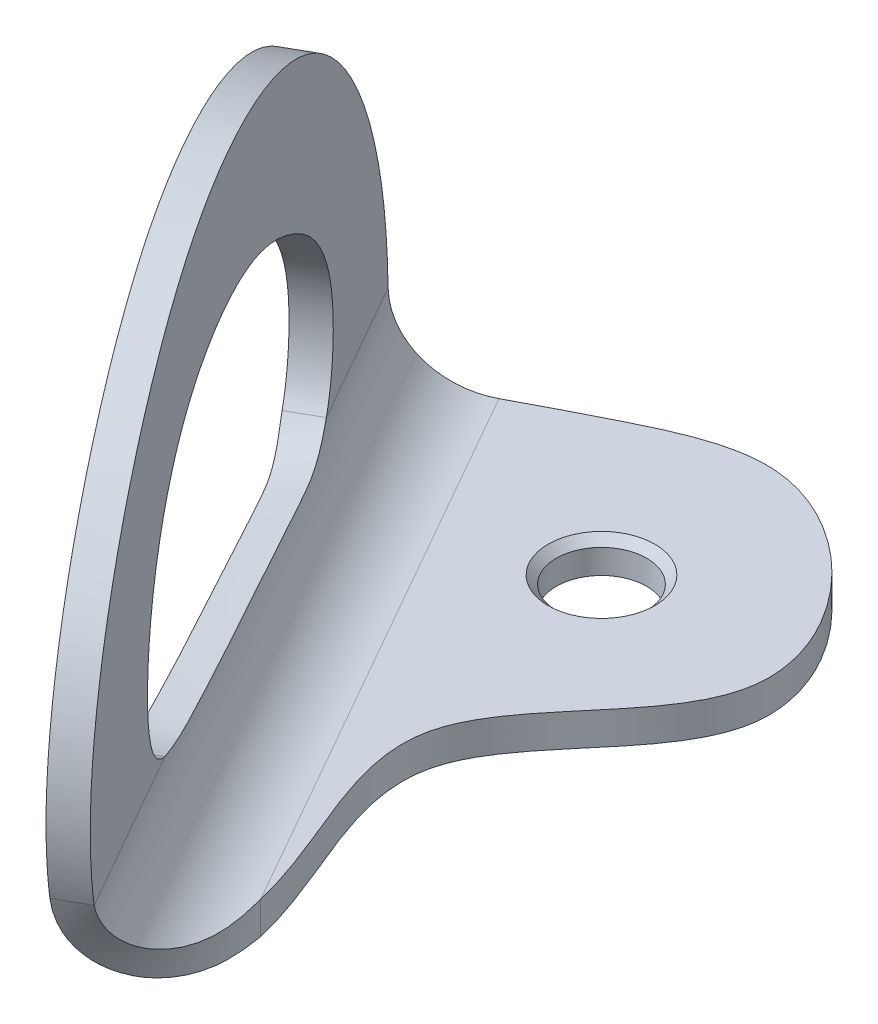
ISO-10303-21;
HEADER;
FILE_DESCRIPTION(('STEP AP214'),'2;1');
FILE_NAME('part.step','',(''),(''),'','','');
FILE_SCHEMA(('AUTOMOTIVE_DESIGN { 1 0 10303 214 1 1 1 1 }'));
ENDSEC;
DATA;
#1=APPLICATION_CONTEXT('core data for automotive mechanical design processes');
#2=APPLICATION_PROTOCOL_DEFINITION('international standard','automotive_design',2000,#1);
#3=PRODUCT_CONTEXT('',#1,'mechanical');
#4=PRODUCT('Part','Part','',(#3));
#5=PRODUCT_RELATED_PRODUCT_CATEGORY('part','',(#4));
#6=PRODUCT_DEFINITION_FORMATION('','',#4);
#7=PRODUCT_DEFINITION_CONTEXT('part definition',#1,'design');
#8=PRODUCT_DEFINITION('design','',#6,#7);
#9=PRODUCT_DEFINITION_SHAPE('','',#8);
#10=(LENGTH_UNIT() NAMED_UNIT(*) SI_UNIT(.MILLI.,.METRE.));
#11=(NAMED_UNIT(*) PLANE_ANGLE_UNIT() SI_UNIT($,.RADIAN.));
#12=(NAMED_UNIT(*) SI_UNIT($,.STERADIAN.) SOLID_ANGLE_UNIT());
#13=UNCERTAINTY_MEASURE_WITH_UNIT(LENGTH_MEASURE(1.E-05),#10,'distance_accuracy_value','');
#14=(GEOMETRIC_REPRESENTATION_CONTEXT(3) GLOBAL_UNCERTAINTY_ASSIGNED_CONTEXT((#13)) GLOBAL_UNIT_ASSIGNED_CONTEXT((#10,
#11,#12)) REPRESENTATION_CONTEXT('',''));
#15=CARTESIAN_POINT('',(0.,0.,0.));
#16=DIRECTION('',(0.,0.,1.));
#17=DIRECTION('',(1.,0.,0.));
#18=AXIS2_PLACEMENT_3D('',#15,#16,#17);
#19=CARTESIAN_POINT('',(8.95499091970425,4.,-63.9385130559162));
#20=CARTESIAN_POINT('',(1.61019037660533,4.,-60.2844287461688));
#21=CARTESIAN_POINT('',(-8.44392676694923,4.,-54.8515736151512));
#22=CARTESIAN_POINT('',(-30.5057869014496,4.,-41.5377467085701));
#23=CARTESIAN_POINT('',(-47.4499714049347,4.,-9.04668699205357));
#24=CARTESIAN_POINT('',(-31.3975102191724,4.,41.3086625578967));
#25=CARTESIAN_POINT('',(22.0584170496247,4.,50.4377812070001));
#26=CARTESIAN_POINT('',(41.9298935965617,4.,19.7943883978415));
#27=CARTESIAN_POINT('',(35.3609661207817,4.,-0.200614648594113));
#28=CARTESIAN_POINT('',(24.4268816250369,4.,-23.2369379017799));
#29=CARTESIAN_POINT('',(57.6170443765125,4.,-42.7161668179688));
#30=CARTESIAN_POINT('',(29.2888530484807,4.,-73.6584525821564));
#31=CARTESIAN_POINT('',(13.8884258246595,4.,-66.3929278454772));
#32=CARTESIAN_POINT('',(8.95499091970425,4.,-63.9385130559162));
#33=B_SPLINE_CURVE_WITH_KNOTS('',3,(#19,#20,#21,#22,#23,#24,#25,#26,#27,#28,#29,#30,#31,#32),
.UNSPECIFIED.,.T.,.F.,(4,1,1,1,1,1,1,1,1,1,1,4),(0.,0.0764014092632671,0.112007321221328,
0.245141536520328,0.390147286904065,0.55494925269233,0.631136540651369,0.690096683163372,
0.752673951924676,0.846630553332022,0.948681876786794,1.),.UNSPECIFIED.);
#34=DIRECTION('',(0.,-1.,0.));
#35=VECTOR('',#34,1.);
#36=SURFACE_OF_LINEAR_EXTRUSION('',#33,#35);
#37=CARTESIAN_POINT('',(8.95499091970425,0.,-63.9385130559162));
#38=CARTESIAN_POINT('',(1.61019037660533,0.,-60.2844287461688));
#39=CARTESIAN_POINT('',(-8.44392676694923,0.,-54.8515736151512));
#40=CARTESIAN_POINT('',(-30.5057869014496,0.,-41.5377467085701));
#41=CARTESIAN_POINT('',(-47.4499714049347,0.,-9.04668699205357));
#42=CARTESIAN_POINT('',(-31.3975102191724,0.,41.3086625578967));
#43=CARTESIAN_POINT('',(22.0584170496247,0.,50.4377812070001));
#44=CARTESIAN_POINT('',(41.9298935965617,0.,19.7943883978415));
#45=CARTESIAN_POINT('',(35.3609661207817,0.,-0.200614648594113));
#46=CARTESIAN_POINT('',(24.4268816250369,0.,-23.2369379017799));
#47=CARTESIAN_POINT('',(57.6170443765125,0.,-42.7161668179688));
#48=CARTESIAN_POINT('',(29.2888530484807,0.,-73.6584525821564));
#49=CARTESIAN_POINT('',(13.8884258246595,0.,-66.3929278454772));
#50=CARTESIAN_POINT('',(8.95499091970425,0.,-63.9385130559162));
#51=B_SPLINE_CURVE_WITH_KNOTS('',3,(#37,#38,#39,#40,#41,#42,#43,#44,#45,#46,#47,#48,#49,#50),
.UNSPECIFIED.,.T.,.F.,(4,1,1,1,1,1,1,1,1,1,1,4),(0.,0.0764014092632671,0.112007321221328,
0.245141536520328,0.390147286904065,0.55494925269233,0.631136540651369,0.690096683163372,
0.752673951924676,0.846630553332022,0.948681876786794,1.),.UNSPECIFIED.);
#52=CARTESIAN_POINT('',(38.0507690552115,0.,9.14936203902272));
#53=VERTEX_POINT('',#52);
#54=CARTESIAN_POINT('',(-0.693611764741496,0.,-58.9601159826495));
#55=VERTEX_POINT('',#54);
#56=EDGE_CURVE('E155',#53,#55,#51,.T.);
#57=ORIENTED_EDGE('',*,*,#56,.T.);
#58=CARTESIAN_POINT('',(-0.693611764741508,0.,-58.9601159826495));
#59=DIRECTION('',(0.,1.,0.));
#60=VECTOR('',#59,1.);
#61=LINE('',#58,#60);
#62=CARTESIAN_POINT('',(-0.69361176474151,4.,-58.9601159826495));
#63=VERTEX_POINT('',#62);
#64=EDGE_CURVE('E95',#55,#63,#61,.T.);
#65=ORIENTED_EDGE('',*,*,#64,.T.);
#66=CARTESIAN_POINT('',(38.0507690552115,4.,9.14936203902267));
#67=VERTEX_POINT('',#66);
#68=EDGE_CURVE('E152',#67,#63,#33,.T.);
#69=ORIENTED_EDGE('',*,*,#68,.F.);
#70=CARTESIAN_POINT('',(38.0507690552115,4.,9.14936203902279));
#71=DIRECTION('',(0.,-1.,0.));
#72=VECTOR('',#71,1.);
#73=LINE('',#70,#72);
#74=EDGE_CURVE('E123',#67,#53,#73,.T.);
#75=ORIENTED_EDGE('',*,*,#74,.T.);
#76=EDGE_LOOP('',(#57,#65,#69,#75));
#77=FACE_BOUND('',#76,.T.);
#78=ADVANCED_FACE('F55',(#77),#36,.F.);
#79=CARTESIAN_POINT('',(9.42199943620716,0.,44.1427367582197));
#80=DIRECTION('',(0.,1.,0.));
#81=DIRECTION('',(0.,0.,1.));
#82=AXIS2_PLACEMENT_3D('',#79,#80,#81);
#83=PLANE('',#82);
#84=CARTESIAN_POINT('',(24.4370593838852,0.,-46.4645755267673));
#85=DIRECTION('',(0.,1.,0.));
#86=DIRECTION('',(0.,0.,1.));
#87=AXIS2_PLACEMENT_3D('',#84,#85,#86);
#88=CIRCLE('',#87,5.57041654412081);
#89=CARTESIAN_POINT('',(24.4370593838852,0.,-40.8941589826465));
#90=VERTEX_POINT('',#89);
#91=EDGE_CURVE('E157',#90,#90,#88,.T.);
#92=ORIENTED_EDGE('',*,*,#91,.T.);
#93=EDGE_LOOP('',(#92));
#94=FACE_BOUND('',#93,.T.);
#95=ORIENTED_EDGE('',*,*,#56,.F.);
#96=DIRECTION('',(-0.494451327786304,0.,-0.869205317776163));
#97=VECTOR('',#96,1.);
#98=CARTESIAN_POINT('',(46.0909898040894,0.,23.2834177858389));
#99=LINE('',#98,#97);
#100=EDGE_CURVE('E133',#53,#55,#99,.T.);
#101=ORIENTED_EDGE('',*,*,#100,.T.);
#102=EDGE_LOOP('',(#95,#101));
#103=FACE_BOUND('',#102,.T.);
#104=ADVANCED_FACE('F178',(#94,#103),#83,.F.);
#105=CARTESIAN_POINT('',(9.42199943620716,4.,44.1427367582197));
#106=DIRECTION('',(0.,1.,0.));
#107=DIRECTION('',(0.,0.,1.));
#108=AXIS2_PLACEMENT_3D('',#105,#106,#107);
#109=PLANE('',#108);
#110=CARTESIAN_POINT('',(24.4370593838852,4.,-46.4645755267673));
#111=DIRECTION('',(0.,1.,0.));
#112=DIRECTION('',(0.,0.,1.));
#113=AXIS2_PLACEMENT_3D('',#110,#111,#112);
#114=CIRCLE('',#113,6.57041654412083);
#115=CARTESIAN_POINT('',(24.4370593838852,4.,-39.8941589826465));
#116=VERTEX_POINT('',#115);
#117=EDGE_CURVE('E12',#116,#116,#114,.F.);
#118=ORIENTED_EDGE('',*,*,#117,.T.);
#119=EDGE_LOOP('',(#118));
#120=FACE_BOUND('',#119,.T.);
#121=DIRECTION('',(-0.494451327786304,0.,-0.869205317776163));
#122=VECTOR('',#121,1.);
#123=CARTESIAN_POINT('',(46.0909898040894,4.,23.2834177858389));
#124=LINE('',#123,#122);
#125=EDGE_CURVE('E142',#67,#63,#124,.T.);
#126=ORIENTED_EDGE('',*,*,#125,.F.);
#127=ORIENTED_EDGE('',*,*,#68,.T.);
#128=EDGE_LOOP('',(#126,#127));
#129=FACE_BOUND('',#128,.T.);
#130=ADVANCED_FACE('F151',(#120,#129),#109,.T.);
#131=CARTESIAN_POINT('',(24.4370593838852,4.,-46.4645755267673));
#132=DIRECTION('',(0.,-1.,0.));
#133=DIRECTION('',(0.,0.,-1.));
#134=AXIS2_PLACEMENT_3D('',#131,#132,#133);
#135=CYLINDRICAL_SURFACE('',#134,5.57041654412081);
#136=CARTESIAN_POINT('',(24.4370593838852,3.00000000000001,-46.4645755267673));
#137=DIRECTION('',(0.,1.,0.));
#138=DIRECTION('',(0.,0.,1.));
#139=AXIS2_PLACEMENT_3D('',#136,#137,#138);
#140=CIRCLE('',#139,5.57041654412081);
#141=CARTESIAN_POINT('',(24.4370593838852,3.00000000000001,-40.8941589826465));
#142=VERTEX_POINT('',#141);
#143=EDGE_CURVE('E63',#142,#142,#140,.T.);
#144=ORIENTED_EDGE('',*,*,#143,.T.);
#145=EDGE_LOOP('',(#144));
#146=FACE_BOUND('',#145,.T.);
#147=ORIENTED_EDGE('',*,*,#91,.F.);
#148=EDGE_LOOP('',(#147));
#149=FACE_BOUND('',#148,.T.);
#150=ADVANCED_FACE('F361',(#146,#149),#135,.F.);
#151=CARTESIAN_POINT('',(34.9665517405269,13.9999999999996,32.0417708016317));
#152=CARTESIAN_POINT('',(34.745218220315,12.4156797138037,31.6526844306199));
#153=CARTESIAN_POINT('',(34.7489471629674,10.977591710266,31.118566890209));
#154=CARTESIAN_POINT('',(34.9155131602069,9.10362536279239,30.1970563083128));
#155=CARTESIAN_POINT('',(34.9981105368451,8.52546846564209,29.8698711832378));
#156=CARTESIAN_POINT('',(35.1436021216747,7.72824023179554,29.3598893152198));
#157=CARTESIAN_POINT('',(35.1957255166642,7.47411560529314,29.1866793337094));
#158=CARTESIAN_POINT('',(35.2772319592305,7.11000879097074,28.9232451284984));
#159=CARTESIAN_POINT('',(35.3049562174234,6.99148427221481,28.834829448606));
#160=CARTESIAN_POINT('',(35.3471282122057,6.8179023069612,28.7014403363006));
#161=CARTESIAN_POINT('',(35.3612832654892,6.7607423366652,28.6568496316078));
#162=CARTESIAN_POINT('',(35.3826325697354,6.67604468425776,28.58978905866));
#163=CARTESIAN_POINT('',(35.3897684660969,6.6479858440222,28.5674064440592));
#164=CARTESIAN_POINT('',(35.40049783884,6.60615700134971,28.5337909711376));
#165=CARTESIAN_POINT('',(35.4040785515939,6.59225728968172,28.5225788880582));
#166=CARTESIAN_POINT('',(35.4112478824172,6.56454414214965,28.5001412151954));
#167=CARTESIAN_POINT('',(35.4141697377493,6.55328663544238,28.4910004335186));
#168=CARTESIAN_POINT('',(35.6910068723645,5.49207540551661,27.6253967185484));
#169=CARTESIAN_POINT('',(36.0264435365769,4.595810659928,26.6822794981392));
#170=CARTESIAN_POINT('',(36.7124413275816,3.08980698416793,24.6772952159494));
#171=CARTESIAN_POINT('',(37.0624497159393,2.48003071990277,23.6169860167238));
#172=CARTESIAN_POINT('',(37.6963769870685,1.49902180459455,21.4188429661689));
#173=CARTESIAN_POINT('',(37.9725350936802,1.13498767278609,20.2930964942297));
#174=CARTESIAN_POINT('',(38.2816499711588,0.72589521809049,18.5894450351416));
#175=CARTESIAN_POINT('',(38.3674219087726,0.61231596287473,18.0189114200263));
#176=CARTESIAN_POINT('',(38.4666985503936,0.469590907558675,17.1611169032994));
#177=CARTESIAN_POINT('',(38.494906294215,0.426625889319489,16.8748459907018));
#178=CARTESIAN_POINT('',(38.5295583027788,0.368310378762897,16.445119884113));
#179=CARTESIAN_POINT('',(38.5398330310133,0.349894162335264,16.3018241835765));
#180=CARTESIAN_POINT('',(38.5532952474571,0.323708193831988,16.0868205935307));
#181=CARTESIAN_POINT('',(38.55745771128,0.31521928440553,16.0151427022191));
#182=CARTESIAN_POINT('',(38.5632098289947,0.302833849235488,15.9076131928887));
#183=CARTESIAN_POINT('',(38.5650452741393,0.298763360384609,15.8717679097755));
#184=CARTESIAN_POINT('',(38.5676750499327,0.292743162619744,15.8179970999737));
#185=CARTESIAN_POINT('',(38.56853107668,0.290750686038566,15.8000730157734));
#186=CARTESIAN_POINT('',(38.5702019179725,0.286794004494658,15.7642239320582));
#187=CARTESIAN_POINT('',(38.5711785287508,0.28443248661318,15.7426469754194));
#188=CARTESIAN_POINT('',(38.6527544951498,0.0841114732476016,13.9013684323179));
#189=CARTESIAN_POINT('',(38.4854869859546,0.,11.7045657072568));
#190=CARTESIAN_POINT('',(38.0507690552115,0.,9.14936203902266));
#191=CARTESIAN_POINT('',(38.4433730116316,13.9999999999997,30.0639654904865));
#192=CARTESIAN_POINT('',(38.2220601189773,12.8684481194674,29.6749153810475));
#193=CARTESIAN_POINT('',(38.159376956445,11.8411369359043,29.1785286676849));
#194=CARTESIAN_POINT('',(38.1768314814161,10.5025895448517,28.3418408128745));
#195=CARTESIAN_POINT('',(38.2014227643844,10.0896203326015,28.0476527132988));
#196=CARTESIAN_POINT('',(38.2528853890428,9.52017159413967,27.5911596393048));
#197=CARTESIAN_POINT('',(38.2724881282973,9.33865400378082,27.4364491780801));
#198=CARTESIAN_POINT('',(38.3040522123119,9.07857770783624,27.2014249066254));
#199=CARTESIAN_POINT('',(38.3149349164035,8.99391733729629,27.1225896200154));
#200=CARTESIAN_POINT('',(38.3316241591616,8.869930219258,27.0036964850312));
#201=CARTESIAN_POINT('',(38.3372481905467,8.82910166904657,26.9639586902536));
#202=CARTESIAN_POINT('',(38.345754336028,8.7686033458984,26.9042040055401));
#203=CARTESIAN_POINT('',(38.3486014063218,8.74856131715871,26.8842611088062));
#204=CARTESIAN_POINT('',(38.3528869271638,8.71868357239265,26.8543112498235));
#205=CARTESIAN_POINT('',(38.354317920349,8.70875520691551,26.8443220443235));
#206=CARTESIAN_POINT('',(38.3571844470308,8.68896010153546,26.8243320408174));
#207=CARTESIAN_POINT('',(38.3583531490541,8.68091902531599,26.8161885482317));
#208=CARTESIAN_POINT('',(38.4691404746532,7.92291100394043,26.0450430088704));
#209=CARTESIAN_POINT('',(38.6163596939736,7.28272189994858,25.2089941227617));
#210=CARTESIAN_POINT('',(38.9080760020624,6.20700498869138,23.4282986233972));
#211=CARTESIAN_POINT('',(39.0523309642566,5.77145051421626,22.4850331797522));
#212=CARTESIAN_POINT('',(39.2794980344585,5.07072986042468,20.5182774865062));
#213=CARTESIAN_POINT('',(39.3578088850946,4.81070548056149,19.5050773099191));
#214=CARTESIAN_POINT('',(39.3909989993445,4.51849658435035,17.9583868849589));
#215=CARTESIAN_POINT('',(39.3881977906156,4.43736854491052,17.4382384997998));
#216=CARTESIAN_POINT('',(39.3607121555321,4.33542207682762,16.6525532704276));
#217=CARTESIAN_POINT('',(39.3476785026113,4.30473277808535,16.3897427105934));
#218=CARTESIAN_POINT('',(39.3220825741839,4.2630788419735,15.9942889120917));
#219=CARTESIAN_POINT('',(39.3125434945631,4.24992440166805,15.8622643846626));
#220=CARTESIAN_POINT('',(39.296698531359,4.23122013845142,15.6639323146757));
#221=CARTESIAN_POINT('',(39.2911608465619,4.22515663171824,15.5977723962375));
#222=CARTESIAN_POINT('',(39.2824672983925,4.21630989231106,15.4984603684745));
#223=CARTESIAN_POINT('',(39.2795049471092,4.21340240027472,15.4653443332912));
#224=CARTESIAN_POINT('',(39.2749643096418,4.2091022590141,15.4156524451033));
#225=CARTESIAN_POINT('',(39.2734345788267,4.20767906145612,15.3990855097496));
#226=CARTESIAN_POINT('',(39.2703426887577,4.20485286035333,15.3659457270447));
#227=CARTESIAN_POINT('',(39.2684589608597,4.20316606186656,15.3459958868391));
#228=CARTESIAN_POINT('',(39.1063274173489,4.06007962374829,13.6433514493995));
#229=CARTESIAN_POINT('',(38.7054281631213,4.,11.5795203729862));
#230=CARTESIAN_POINT('',(38.0507690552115,4.,9.14936203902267));
#231=B_SPLINE_SURFACE_WITH_KNOTS('',1,3,((#151,#152,#153,#154,#155,#156,#157,#158,#159,#160,
#161,#162,#163,#164,#165,#166,#167,#168,#169,#170,#171,#172,#173,#174,#175,#176,#177,#178,#179,
#180,#181,#182,#183,#184,#185,#186,#187,#188,#189,#190),(#191,#192,#193,#194,#195,#196,#197,
#198,#199,#200,#201,#202,#203,#204,#205,#206,#207,#208,#209,#210,#211,#212,#213,#214,#215,#216,
#217,#218,#219,#220,#221,#222,#223,#224,#225,#226,#227,#228,#229,#230)),.UNSPECIFIED.,.F.,.F.,
.F.,(2,2),(4,2,2,2,2,2,2,2,2,2,2,2,2,2,2,2,2,2,2,4),(0.,1.),(0.,0.125,0.1875,0.21875,0.234375,
0.2421875,0.24609375,0.248046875,0.25,0.375,0.5,0.625,0.6875,0.71875,0.734375,0.7421875,
0.74609375,0.748046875,0.75,1.),.UNSPECIFIED.);
#232=CARTESIAN_POINT('',(38.4433730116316,13.9999999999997,30.0639654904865));
#233=CARTESIAN_POINT('',(34.9665517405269,13.9999999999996,32.0417708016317));
#234=B_SPLINE_CURVE_WITH_KNOTS('',1,(#232,#233),.UNSPECIFIED.,.F.,.F.,(2,2),(0.,1.),.UNSPECIFIED.);
#235=CARTESIAN_POINT('',(38.4433730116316,13.9999999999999,30.0639654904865));
#236=VERTEX_POINT('',#235);
#237=CARTESIAN_POINT('',(34.966551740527,14.,32.0417708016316));
#238=VERTEX_POINT('',#237);
#239=EDGE_CURVE('E271',#236,#238,#234,.T.);
#240=CARTESIAN_POINT('',(34.9665517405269,13.9999999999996,32.0417708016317));
#241=CARTESIAN_POINT('',(34.745218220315,12.4156797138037,31.6526844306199));
#242=CARTESIAN_POINT('',(34.7489471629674,10.977591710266,31.118566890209));
#243=CARTESIAN_POINT('',(34.9155131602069,9.10362536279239,30.1970563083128));
#244=CARTESIAN_POINT('',(34.9981105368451,8.52546846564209,29.8698711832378));
#245=CARTESIAN_POINT('',(35.1436021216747,7.72824023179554,29.3598893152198));
#246=CARTESIAN_POINT('',(35.1957255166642,7.47411560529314,29.1866793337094));
#247=CARTESIAN_POINT('',(35.2772319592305,7.11000879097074,28.9232451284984));
#248=CARTESIAN_POINT('',(35.3049562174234,6.99148427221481,28.834829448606));
#249=CARTESIAN_POINT('',(35.3471282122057,6.8179023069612,28.7014403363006));
#250=CARTESIAN_POINT('',(35.3612832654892,6.7607423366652,28.6568496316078));
#251=CARTESIAN_POINT('',(35.3826325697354,6.67604468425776,28.58978905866));
#252=CARTESIAN_POINT('',(35.3897684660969,6.6479858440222,28.5674064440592));
#253=CARTESIAN_POINT('',(35.40049783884,6.60615700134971,28.5337909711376));
#254=CARTESIAN_POINT('',(35.4040785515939,6.59225728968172,28.5225788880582));
#255=CARTESIAN_POINT('',(35.4112478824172,6.56454414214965,28.5001412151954));
#256=CARTESIAN_POINT('',(35.4141697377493,6.55328663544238,28.4910004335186));
#257=CARTESIAN_POINT('',(35.6910068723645,5.49207540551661,27.6253967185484));
#258=CARTESIAN_POINT('',(36.0264435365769,4.595810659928,26.6822794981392));
#259=CARTESIAN_POINT('',(36.7124413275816,3.08980698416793,24.6772952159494));
#260=CARTESIAN_POINT('',(37.0624497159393,2.48003071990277,23.6169860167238));
#261=CARTESIAN_POINT('',(37.6963769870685,1.49902180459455,21.4188429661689));
#262=CARTESIAN_POINT('',(37.9725350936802,1.13498767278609,20.2930964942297));
#263=CARTESIAN_POINT('',(38.2816499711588,0.72589521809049,18.5894450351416));
#264=CARTESIAN_POINT('',(38.3674219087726,0.61231596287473,18.0189114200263));
#265=CARTESIAN_POINT('',(38.4666985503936,0.469590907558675,17.1611169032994));
#266=CARTESIAN_POINT('',(38.494906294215,0.426625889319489,16.8748459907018));
#267=CARTESIAN_POINT('',(38.5295583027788,0.368310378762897,16.445119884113));
#268=CARTESIAN_POINT('',(38.5398330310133,0.349894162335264,16.3018241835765));
#269=CARTESIAN_POINT('',(38.5532952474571,0.323708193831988,16.0868205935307));
#270=CARTESIAN_POINT('',(38.55745771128,0.31521928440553,16.0151427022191));
#271=CARTESIAN_POINT('',(38.5632098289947,0.302833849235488,15.9076131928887));
#272=CARTESIAN_POINT('',(38.5650452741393,0.298763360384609,15.8717679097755));
#273=CARTESIAN_POINT('',(38.5676750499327,0.292743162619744,15.8179970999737));
#274=CARTESIAN_POINT('',(38.56853107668,0.290750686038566,15.8000730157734));
#275=CARTESIAN_POINT('',(38.5702019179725,0.286794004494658,15.7642239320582));
#276=CARTESIAN_POINT('',(38.5711785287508,0.28443248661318,15.7426469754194));
#277=CARTESIAN_POINT('',(38.6527544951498,0.0841114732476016,13.9013684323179));
#278=CARTESIAN_POINT('',(38.4854869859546,0.,11.7045657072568));
#279=CARTESIAN_POINT('',(38.0507690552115,0.,9.14936203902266));
#280=B_SPLINE_CURVE_WITH_KNOTS('',3,(#240,#241,#242,#243,#244,#245,#246,#247,#248,#249,#250,
#251,#252,#253,#254,#255,#256,#257,#258,#259,#260,#261,#262,#263,#264,#265,#266,#267,#268,#269,
#270,#271,#272,#273,#274,#275,#276,#277,#278,#279),.UNSPECIFIED.,.F.,.F.,(4,2,2,2,2,2,2,2,2,2,2,
2,2,2,2,2,2,2,2,4),(0.,0.125,0.1875,0.21875,0.234375,0.2421875,0.24609375,0.248046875,0.25,
0.375,0.5,0.625,0.6875,0.71875,0.734375,0.7421875,0.74609375,0.748046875,0.75,1.),.UNSPECIFIED.);
#281=EDGE_CURVE('E70',#238,#53,#280,.T.);
#282=CARTESIAN_POINT('',(38.0507690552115,4.,9.14936203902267));
#283=CARTESIAN_POINT('',(38.7054281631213,4.,11.5795203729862));
#284=CARTESIAN_POINT('',(39.1063274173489,4.06007962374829,13.6433514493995));
#285=CARTESIAN_POINT('',(39.2684589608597,4.20316606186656,15.3459958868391));
#286=CARTESIAN_POINT('',(39.2703426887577,4.20485286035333,15.3659457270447));
#287=CARTESIAN_POINT('',(39.2734345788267,4.20767906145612,15.3990855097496));
#288=CARTESIAN_POINT('',(39.2749643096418,4.2091022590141,15.4156524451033));
#289=CARTESIAN_POINT('',(39.2795049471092,4.21340240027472,15.4653443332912));
#290=CARTESIAN_POINT('',(39.2824672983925,4.21630989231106,15.4984603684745));
#291=CARTESIAN_POINT('',(39.2911608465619,4.22515663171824,15.5977723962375));
#292=CARTESIAN_POINT('',(39.296698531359,4.23122013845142,15.6639323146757));
#293=CARTESIAN_POINT('',(39.3125434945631,4.24992440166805,15.8622643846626));
#294=CARTESIAN_POINT('',(39.3220825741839,4.2630788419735,15.9942889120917));
#295=CARTESIAN_POINT('',(39.3476785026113,4.30473277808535,16.3897427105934));
#296=CARTESIAN_POINT('',(39.3607121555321,4.33542207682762,16.6525532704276));
#297=CARTESIAN_POINT('',(39.3881977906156,4.43736854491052,17.4382384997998));
#298=CARTESIAN_POINT('',(39.3909989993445,4.51849658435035,17.9583868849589));
#299=CARTESIAN_POINT('',(39.3578088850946,4.81070548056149,19.5050773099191));
#300=CARTESIAN_POINT('',(39.2794980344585,5.07072986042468,20.5182774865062));
#301=CARTESIAN_POINT('',(39.0523309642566,5.77145051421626,22.4850331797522));
#302=CARTESIAN_POINT('',(38.9080760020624,6.20700498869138,23.4282986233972));
#303=CARTESIAN_POINT('',(38.6163596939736,7.28272189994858,25.2089941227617));
#304=CARTESIAN_POINT('',(38.4691404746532,7.92291100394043,26.0450430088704));
#305=CARTESIAN_POINT('',(38.3583531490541,8.68091902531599,26.8161885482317));
#306=CARTESIAN_POINT('',(38.3571844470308,8.68896010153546,26.8243320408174));
#307=CARTESIAN_POINT('',(38.354317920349,8.70875520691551,26.8443220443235));
#308=CARTESIAN_POINT('',(38.3528869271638,8.71868357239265,26.8543112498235));
#309=CARTESIAN_POINT('',(38.3486014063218,8.74856131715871,26.8842611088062));
#310=CARTESIAN_POINT('',(38.345754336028,8.7686033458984,26.9042040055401));
#311=CARTESIAN_POINT('',(38.3372481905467,8.82910166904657,26.9639586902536));
#312=CARTESIAN_POINT('',(38.3316241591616,8.869930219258,27.0036964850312));
#313=CARTESIAN_POINT('',(38.3149349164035,8.99391733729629,27.1225896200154));
#314=CARTESIAN_POINT('',(38.3040522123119,9.07857770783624,27.2014249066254));
#315=CARTESIAN_POINT('',(38.2724881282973,9.33865400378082,27.4364491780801));
#316=CARTESIAN_POINT('',(38.2528853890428,9.52017159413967,27.5911596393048));
#317=CARTESIAN_POINT('',(38.2014227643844,10.0896203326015,28.0476527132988));
#318=CARTESIAN_POINT('',(38.1768314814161,10.5025895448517,28.3418408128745));
#319=CARTESIAN_POINT('',(38.159376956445,11.8411369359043,29.1785286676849));
#320=CARTESIAN_POINT('',(38.2220601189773,12.8684481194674,29.6749153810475));
#321=CARTESIAN_POINT('',(38.4433730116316,13.9999999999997,30.0639654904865));
#322=B_SPLINE_CURVE_WITH_KNOTS('',3,(#282,#283,#284,#285,#286,#287,#288,#289,#290,#291,#292,
#293,#294,#295,#296,#297,#298,#299,#300,#301,#302,#303,#304,#305,#306,#307,#308,#309,#310,#311,
#312,#313,#314,#315,#316,#317,#318,#319,#320,#321),.UNSPECIFIED.,.F.,.F.,(4,2,2,2,2,2,2,2,2,2,2,
2,2,2,2,2,2,2,2,4),(0.,0.25,0.251953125,0.25390625,0.2578125,0.265625,0.28125,0.3125,0.375,0.5,
0.625,0.75,0.751953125,0.75390625,0.7578125,0.765625,0.78125,0.8125,0.875,1.),.UNSPECIFIED.);
#323=EDGE_CURVE('E127',#236,#67,#322,.F.);
#324=ORIENTED_EDGE('',*,*,#239,.T.);
#325=ORIENTED_EDGE('',*,*,#281,.T.);
#326=ORIENTED_EDGE('',*,*,#74,.F.);
#327=ORIENTED_EDGE('',*,*,#323,.F.);
#328=EDGE_LOOP('',(#324,#325,#326,#327));
#329=FACE_BOUND('',#328,.T.);
#330=ADVANCED_FACE('F126',(#329),#231,.F.);
#331=CARTESIAN_POINT('',(-0.693611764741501,0.,-58.9601159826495));
#332=CARTESIAN_POINT('',(-2.5242434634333,0.,-57.9641724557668));
#333=CARTESIAN_POINT('',(-4.2847089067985,0.469434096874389,-56.9950581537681));
#334=CARTESIAN_POINT('',(-7.38972571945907,2.11022641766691,-55.2675978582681));
#335=CARTESIAN_POINT('',(-8.7319982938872,3.27829192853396,-54.5104908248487));
#336=CARTESIAN_POINT('',(-10.8560484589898,6.00419680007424,-53.2891758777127));
#337=CARTESIAN_POINT('',(-11.6389456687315,7.55976776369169,-52.8243310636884));
#338=CARTESIAN_POINT('',(-12.6371483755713,10.7661311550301,-52.1915775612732));
#339=CARTESIAN_POINT('',(-12.8539414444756,12.4170736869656,-52.022776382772));
#340=CARTESIAN_POINT('',(-12.8288614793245,14.0000000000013,-51.9786878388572));
#341=CARTESIAN_POINT('',(-0.693611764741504,4.,-58.9601159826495));
#342=CARTESIAN_POINT('',(-2.00678251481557,4.,-58.2585324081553));
#343=CARTESIAN_POINT('',(-3.26822887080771,4.33531006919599,-57.5732873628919));
#344=CARTESIAN_POINT('',(-5.49086764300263,5.50730458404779,-56.3477717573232));
#345=CARTESIAN_POINT('',(-6.45042587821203,6.34163709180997,-55.808373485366));
#346=CARTESIAN_POINT('',(-7.96600338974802,8.28871200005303,-54.9331909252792));
#347=CARTESIAN_POINT('',(-8.52282239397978,9.39983411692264,-54.5969517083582));
#348=CARTESIAN_POINT('',(-9.22785235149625,11.6900936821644,-54.1309708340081));
#349=CARTESIAN_POINT('',(-9.37712019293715,12.8693374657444,-54.000581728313));
#350=CARTESIAN_POINT('',(-9.35204020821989,14.000000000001,-53.9564931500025));
#351=B_SPLINE_SURFACE_WITH_KNOTS('',1,3,((#331,#332,#333,#334,#335,#336,#337,#338,#339,#340),
(#341,#342,#343,#344,#345,#346,#347,#348,#349,#350)),.UNSPECIFIED.,.F.,.F.,.F.,(2,2),(4,2,2,2,
4),(0.,1.),(0.,0.25,0.5,0.75,1.),.UNSPECIFIED.);
#352=CARTESIAN_POINT('',(-0.693611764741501,0.,-58.9601159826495));
#353=CARTESIAN_POINT('',(-2.5242434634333,0.,-57.9641724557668));
#354=CARTESIAN_POINT('',(-4.2847089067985,0.469434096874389,-56.9950581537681));
#355=CARTESIAN_POINT('',(-7.38972571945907,2.11022641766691,-55.2675978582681));
#356=CARTESIAN_POINT('',(-8.7319982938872,3.27829192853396,-54.5104908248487));
#357=CARTESIAN_POINT('',(-10.8560484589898,6.00419680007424,-53.2891758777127));
#358=CARTESIAN_POINT('',(-11.6389456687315,7.55976776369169,-52.8243310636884));
#359=CARTESIAN_POINT('',(-12.6371483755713,10.7661311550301,-52.1915775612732));
#360=CARTESIAN_POINT('',(-12.8539414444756,12.4170736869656,-52.022776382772));
#361=CARTESIAN_POINT('',(-12.8288614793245,14.0000000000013,-51.9786878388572));
#362=B_SPLINE_CURVE_WITH_KNOTS('',3,(#352,#353,#354,#355,#356,#357,#358,#359,#360,#361),
.UNSPECIFIED.,.F.,.F.,(4,2,2,2,4),(0.,0.25,0.5,0.75,1.),.UNSPECIFIED.);
#363=CARTESIAN_POINT('',(-12.8288614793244,14.0000000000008,-51.9786878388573));
#364=VERTEX_POINT('',#363);
#365=EDGE_CURVE('E424',#55,#364,#362,.T.);
#366=CARTESIAN_POINT('',(-12.8288614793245,14.0000000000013,-51.9786878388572));
#367=CARTESIAN_POINT('',(-9.35204020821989,14.000000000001,-53.9564931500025));
#368=B_SPLINE_CURVE_WITH_KNOTS('',1,(#366,#367),.UNSPECIFIED.,.F.,.F.,(2,2),(0.,1.),.UNSPECIFIED.);
#369=CARTESIAN_POINT('',(-9.35204020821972,14.0000000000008,-53.9564931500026));
#370=VERTEX_POINT('',#369);
#371=EDGE_CURVE('E195',#364,#370,#368,.T.);
#372=CARTESIAN_POINT('',(-9.35204020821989,14.000000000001,-53.9564931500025));
#373=CARTESIAN_POINT('',(-9.37712019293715,12.8693374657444,-54.000581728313));
#374=CARTESIAN_POINT('',(-9.22785235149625,11.6900936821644,-54.1309708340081));
#375=CARTESIAN_POINT('',(-8.52282239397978,9.39983411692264,-54.5969517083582));
#376=CARTESIAN_POINT('',(-7.96600338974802,8.28871200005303,-54.9331909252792));
#377=CARTESIAN_POINT('',(-6.45042587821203,6.34163709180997,-55.808373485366));
#378=CARTESIAN_POINT('',(-5.49086764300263,5.50730458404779,-56.3477717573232));
#379=CARTESIAN_POINT('',(-3.26822887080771,4.33531006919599,-57.5732873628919));
#380=CARTESIAN_POINT('',(-2.00678251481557,4.,-58.2585324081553));
#381=CARTESIAN_POINT('',(-0.693611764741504,4.,-58.9601159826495));
#382=B_SPLINE_CURVE_WITH_KNOTS('',3,(#372,#373,#374,#375,#376,#377,#378,#379,#380,#381),
.UNSPECIFIED.,.F.,.F.,(4,2,2,2,4),(0.,0.25,0.5,0.75,1.),.UNSPECIFIED.);
#383=EDGE_CURVE('E145',#63,#370,#382,.F.);
#384=ORIENTED_EDGE('',*,*,#64,.F.);
#385=ORIENTED_EDGE('',*,*,#365,.T.);
#386=ORIENTED_EDGE('',*,*,#371,.T.);
#387=ORIENTED_EDGE('',*,*,#383,.F.);
#388=EDGE_LOOP('',(#384,#385,#386,#387));
#389=FACE_BOUND('',#388,.T.);
#390=ADVANCED_FACE('F328',(#389),#351,.F.);
#391=CARTESIAN_POINT('',(-2.78541676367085,14.0000000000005,-34.3231268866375));
#392=CARTESIAN_POINT('',(-2.46647588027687,13.036636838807,-33.7624546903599));
#393=CARTESIAN_POINT('',(-1.9726760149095,12.2796667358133,-33.0863407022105));
#394=CARTESIAN_POINT('',(-1.09830422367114,11.454060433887,-31.8237249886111));
#395=CARTESIAN_POINT('',(-0.783887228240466,11.2301752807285,-31.3619507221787));
#396=CARTESIAN_POINT('',(-0.287403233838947,10.9696500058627,-30.6024855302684));
#397=CARTESIAN_POINT('',(-0.117719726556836,10.8953562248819,-30.3382225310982));
#398=CARTESIAN_POINT('',(0.142297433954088,10.8025495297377,-29.9247159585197));
#399=CARTESIAN_POINT('',(0.229887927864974,10.7747200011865,-29.7840300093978));
#400=CARTESIAN_POINT('',(0.362576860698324,10.7376155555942,-29.5686833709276));
#401=CARTESIAN_POINT('',(0.407023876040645,10.7260207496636,-29.4961816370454));
#402=CARTESIAN_POINT('',(0.474012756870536,10.709786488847,-29.3863453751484));
#403=CARTESIAN_POINT('',(0.496395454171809,10.7045680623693,-29.3495526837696));
#404=CARTESIAN_POINT('',(0.530048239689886,10.6970296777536,-29.2940922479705));
#405=CARTESIAN_POINT('',(0.541278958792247,10.6945650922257,-29.2755602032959));
#406=CARTESIAN_POINT('',(0.558144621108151,10.6909404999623,-29.2476942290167));
#407=CARTESIAN_POINT('',(0.563769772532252,10.6897443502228,-29.2383942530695));
#408=CARTESIAN_POINT('',(0.572212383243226,10.6879681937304,-29.2244273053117));
#409=CARTESIAN_POINT('',(0.57502740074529,10.6873791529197,-29.2197688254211));
#410=CARTESIAN_POINT('',(0.580659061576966,10.6862070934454,-29.2104462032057));
#411=CARTESIAN_POINT('',(0.585130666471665,10.6852833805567,-29.2030406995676));
#412=CARTESIAN_POINT('',(0.883891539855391,10.6237797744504,-28.7081582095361));
#413=CARTESIAN_POINT('',(1.3092902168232,10.5966035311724,-27.9743503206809));
#414=CARTESIAN_POINT('',(2.13828950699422,10.6067450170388,-26.511907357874));
#415=CARTESIAN_POINT('',(2.44646027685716,10.6186156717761,-25.9641496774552));
#416=CARTESIAN_POINT('',(2.95656008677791,10.6491817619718,-25.0521476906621));
#417=CARTESIAN_POINT('',(3.13456859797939,10.6614975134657,-24.7330868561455));
#418=CARTESIAN_POINT('',(3.41356683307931,10.6831680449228,-24.2319182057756));
#419=CARTESIAN_POINT('',(3.5085639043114,10.6909243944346,-24.0610991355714));
#420=CARTESIAN_POINT('',(3.65405956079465,10.7033591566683,-23.7992282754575));
#421=CARTESIAN_POINT('',(3.70305812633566,10.7076374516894,-23.710997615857));
#422=CARTESIAN_POINT('',(3.77730648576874,10.7142550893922,-23.5772413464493));
#423=CARTESIAN_POINT('',(3.80218102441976,10.7164943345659,-23.5324208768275));
#424=CARTESIAN_POINT('',(3.83968052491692,10.7199032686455,-23.4648376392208));
#425=CARTESIAN_POINT('',(3.85221164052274,10.7210479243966,-23.4422511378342));
#426=CARTESIAN_POINT('',(3.87105524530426,10.722777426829,-23.4082832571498));
#427=CARTESIAN_POINT('',(3.87734426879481,10.7233560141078,-23.396945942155));
#428=CARTESIAN_POINT('',(3.88678953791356,10.7242270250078,-23.3799179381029));
#429=CARTESIAN_POINT('',(3.88993991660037,10.7245178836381,-23.3742382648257));
#430=CARTESIAN_POINT('',(3.89624458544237,10.7251006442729,-23.362871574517));
#431=CARTESIAN_POINT('',(3.90160403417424,10.7255968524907,-23.3532086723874));
#432=CARTESIAN_POINT('',(4.38951187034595,10.7708011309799,-22.4735143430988));
#433=CARTESIAN_POINT('',(5.17969059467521,10.8302469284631,-21.0559556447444));
#434=CARTESIAN_POINT('',(6.82052550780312,10.9410992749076,-18.1206662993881));
#435=CARTESIAN_POINT('',(7.44340199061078,10.9816647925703,-17.0074134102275));
#436=CARTESIAN_POINT('',(8.49173931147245,11.0479646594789,-15.1353707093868));
#437=CARTESIAN_POINT('',(8.86018908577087,11.0709732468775,-14.4776627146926));
#438=CARTESIAN_POINT('',(9.44138753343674,11.1068530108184,-13.4405701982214));
#439=CARTESIAN_POINT('',(9.63987432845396,11.1190407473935,-13.086450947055));
#440=CARTESIAN_POINT('',(9.94473784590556,11.1376645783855,-12.5426407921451));
#441=CARTESIAN_POINT('',(10.0475479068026,11.143929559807,-12.3592655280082));
#442=CARTESIAN_POINT('',(10.2035466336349,11.153412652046,-12.0810449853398));
#443=CARTESIAN_POINT('',(10.2558434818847,11.1565879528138,-11.9877785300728));
#444=CARTESIAN_POINT('',(10.3347347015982,11.1613723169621,-11.8470894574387));
#445=CARTESIAN_POINT('',(10.3611060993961,11.1629706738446,-11.8000615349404));
#446=CARTESIAN_POINT('',(10.4007746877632,11.1653735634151,-11.7293223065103));
#447=CARTESIAN_POINT('',(10.4140161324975,11.1661754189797,-11.70570967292));
#448=CARTESIAN_POINT('',(10.4339061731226,11.1673795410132,-11.6702413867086));
#449=CARTESIAN_POINT('',(10.4405408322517,11.1677811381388,-11.6584104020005));
#450=CARTESIAN_POINT('',(10.4538194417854,11.1685847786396,-11.6347319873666));
#451=CARTESIAN_POINT('',(10.4619169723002,11.1690747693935,-11.6202925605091));
#452=CARTESIAN_POINT('',(11.7970360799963,11.249854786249,-9.23953307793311));
#453=CARTESIAN_POINT('',(13.0078442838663,11.3395584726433,-7.07505081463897));
#454=CARTESIAN_POINT('',(14.6460853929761,11.4881027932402,-4.13924746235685));
#455=CARTESIAN_POINT('',(15.1625054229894,11.5399490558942,-3.21246722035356));
#456=CARTESIAN_POINT('',(15.8927465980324,11.621231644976,-1.90008598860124));
#457=CARTESIAN_POINT('',(16.128762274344,11.6489113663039,-1.47559048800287));
#458=CARTESIAN_POINT('',(16.4717022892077,11.6913111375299,-0.858302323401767));
#459=CARTESIAN_POINT('',(16.5841683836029,11.7055910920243,-0.65578211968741));
#460=CARTESIAN_POINT('',(16.7500984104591,11.7272312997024,-0.356866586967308));
#461=CARTESIAN_POINT('',(16.8049469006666,11.7344814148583,-0.258038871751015));
#462=CARTESIAN_POINT('',(16.8865275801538,11.7454116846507,-0.111013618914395));
#463=CARTESIAN_POINT('',(16.9136057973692,11.749064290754,-0.0622079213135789));
#464=CARTESIAN_POINT('',(16.9540501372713,11.7545569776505,0.010696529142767));
#465=CARTESIAN_POINT('',(16.96750275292,11.7563901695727,0.0349473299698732));
#466=CARTESIAN_POINT('',(16.9876384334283,11.759143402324,0.0712475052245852));
#467=CARTESIAN_POINT('',(16.9943431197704,11.7600617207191,0.0833348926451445));
#468=CARTESIAN_POINT('',(17.0043893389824,11.7614400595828,0.101446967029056));
#469=CARTESIAN_POINT('',(17.0077362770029,11.7618996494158,0.107481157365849));
#470=CARTESIAN_POINT('',(17.0127539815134,11.7625892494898,0.116527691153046));
#471=CARTESIAN_POINT('',(17.0144260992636,11.7628191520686,0.119542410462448));
#472=CARTESIAN_POINT('',(17.017769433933,11.763279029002,0.125570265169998));
#473=CARTESIAN_POINT('',(17.0182068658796,11.7633391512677,0.126358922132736));
#474=CARTESIAN_POINT('',(17.7646765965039,11.8661037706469,1.47222214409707));
#475=CARTESIAN_POINT('',(18.4075220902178,11.9644163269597,2.63210903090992));
#476=CARTESIAN_POINT('',(19.2203617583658,12.105712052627,4.10102864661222));
#477=CARTESIAN_POINT('',(19.4660705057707,12.1517820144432,4.54551656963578));
#478=CARTESIAN_POINT('',(19.796735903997,12.2193341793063,5.14454385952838));
#479=CARTESIAN_POINT('',(19.9006414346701,12.2415927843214,5.33293551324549));
#480=CARTESIAN_POINT('',(20.0470203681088,12.2745913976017,5.59859965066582));
#481=CARTESIAN_POINT('',(20.0942334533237,12.2855260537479,5.68433380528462));
#482=CARTESIAN_POINT('',(20.1626826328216,12.3018305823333,5.80870454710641));
#483=CARTESIAN_POINT('',(20.18510395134,12.3072491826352,5.84945637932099));
#484=CARTESIAN_POINT('',(20.2181432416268,12.3153527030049,5.90952654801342));
#485=CARTESIAN_POINT('',(20.2290575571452,12.3180498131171,5.92937367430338));
#486=CARTESIAN_POINT('',(20.2452808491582,12.3220893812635,5.95887997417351));
#487=CARTESIAN_POINT('',(20.2506639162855,12.3234348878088,5.96867134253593));
#488=CARTESIAN_POINT('',(20.2587014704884,12.3254516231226,5.98329229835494));
#489=CARTESIAN_POINT('',(20.2613744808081,12.3261236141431,5.98815493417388));
#490=CARTESIAN_POINT('',(20.266708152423,12.3274670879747,5.99785817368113));
#491=CARTESIAN_POINT('',(20.2672934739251,12.3276137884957,5.99892289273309));
#492=CARTESIAN_POINT('',(21.4828588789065,12.6349886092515,8.21052927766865));
#493=CARTESIAN_POINT('',(22.5164746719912,13.1915123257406,10.1555454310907));
#494=CARTESIAN_POINT('',(23.4511832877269,14.0000000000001,11.7986873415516));
#495=CARTESIAN_POINT('',(0.691404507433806,14.0000000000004,-36.3009321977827));
#496=CARTESIAN_POINT('',(1.01029905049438,13.3119834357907,-35.7403414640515));
#497=CARTESIAN_POINT('',(1.48057538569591,12.7711905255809,-35.0507381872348));
#498=CARTESIAN_POINT('',(2.32124520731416,12.1814717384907,-33.7689509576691));
#499=CARTESIAN_POINT('',(2.62449464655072,12.0215537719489,-33.30082397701));
#500=CARTESIAN_POINT('',(3.10706441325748,11.8354642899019,-32.5334436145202));
#501=CARTESIAN_POINT('',(3.27256962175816,11.782397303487,-32.2668037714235));
#502=CARTESIAN_POINT('',(3.52723510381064,11.7161068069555,-31.8502528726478));
#503=CARTESIAN_POINT('',(3.61319353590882,11.6962285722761,-31.7086385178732));
#504=CARTESIAN_POINT('',(3.74368325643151,11.669725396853,-31.4920408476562));
#505=CARTESIAN_POINT('',(3.78743863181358,11.6614433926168,-31.419145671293));
#506=CARTESIAN_POINT('',(3.85345439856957,11.6498474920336,-31.3087558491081));
#507=CARTESIAN_POINT('',(3.87552344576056,11.6461200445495,-31.271784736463));
#508=CARTESIAN_POINT('',(3.90872208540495,11.6407354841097,-31.216065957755));
#509=CARTESIAN_POINT('',(3.919804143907,11.6389750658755,-31.1974493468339));
#510=CARTESIAN_POINT('',(3.936450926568,11.6363860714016,-31.1694588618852));
#511=CARTESIAN_POINT('',(3.94200380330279,11.6355316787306,-31.1601177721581));
#512=CARTESIAN_POINT('',(3.95033903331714,11.6342629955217,-31.1460897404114));
#513=CARTESIAN_POINT('',(3.95311842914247,11.6338422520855,-31.1414109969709));
#514=CARTESIAN_POINT('',(3.95867919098,11.6330050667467,-31.1320480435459));
#515=CARTESIAN_POINT('',(3.96309489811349,11.6323452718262,-31.1246107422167));
#516=CARTESIAN_POINT('',(4.25813327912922,11.5884141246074,-30.6276106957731));
#517=CARTESIAN_POINT('',(4.68181179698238,11.569002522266,-29.8928242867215));
#518=CARTESIAN_POINT('',(5.51144095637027,11.576246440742,-28.4307396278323));
#519=CARTESIAN_POINT('',(5.82035075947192,11.5847254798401,-27.8834023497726));
#520=CARTESIAN_POINT('',(6.33232783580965,11.6065584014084,-26.9724682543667));
#521=CARTESIAN_POINT('',(6.51108985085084,11.6153553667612,-26.6538360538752));
#522=CARTESIAN_POINT('',(6.79140350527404,11.630834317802,-26.1534156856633));
#523=CARTESIAN_POINT('',(6.88686988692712,11.6363745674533,-25.9828635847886));
#524=CARTESIAN_POINT('',(7.03311474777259,11.6452565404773,-25.7214189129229));
#525=CARTESIAN_POINT('',(7.0823705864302,11.6483124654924,-25.633334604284));
#526=CARTESIAN_POINT('',(7.1570160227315,11.6530393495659,-25.4998042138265));
#527=CARTESIAN_POINT('',(7.18202478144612,11.6546388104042,-25.4550600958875));
#528=CARTESIAN_POINT('',(7.2197283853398,11.6570737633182,-25.3875929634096));
#529=CARTESIAN_POINT('',(7.23232799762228,11.657891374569,-25.3650454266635));
#530=CARTESIAN_POINT('',(7.25127503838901,11.6591267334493,-25.3311363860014));
#531=CARTESIAN_POINT('',(7.25759865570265,11.659540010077,-25.3198187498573));
#532=CARTESIAN_POINT('',(7.26709598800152,11.6601621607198,-25.3028203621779));
#533=CARTESIAN_POINT('',(7.27026374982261,11.6603699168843,-25.2971505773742));
#534=CARTESIAN_POINT('',(7.27660324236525,11.6607861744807,-25.2858036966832));
#535=CARTESIAN_POINT('',(7.28199233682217,11.6611406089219,-25.2761576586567));
#536=CARTESIAN_POINT('',(7.77260065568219,11.6934293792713,-24.3979995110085));
#537=CARTESIAN_POINT('',(8.56627761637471,11.7358906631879,-22.9824308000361));
#538=CARTESIAN_POINT('',(10.2133547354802,11.8150709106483,-20.0506923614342));
#539=CARTESIAN_POINT('',(10.8384767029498,11.8440462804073,-18.9387168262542));
#540=CARTESIAN_POINT('',(11.8903935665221,11.8914033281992,-17.0687103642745));
#541=CARTESIAN_POINT('',(12.2600716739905,11.9078380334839,-16.411701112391));
#542=CARTESIAN_POINT('',(12.8431602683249,11.9334664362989,-15.3756838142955));
#543=CARTESIAN_POINT('',(13.042285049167,11.942171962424,-15.0219274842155));
#544=CARTESIAN_POINT('',(13.3481167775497,11.9554746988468,-14.4786681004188));
#545=CARTESIAN_POINT('',(13.4512514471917,11.9599496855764,-14.2954774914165));
#546=CARTESIAN_POINT('',(13.6077398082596,11.96672332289,-14.0175354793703));
#547=CARTESIAN_POINT('',(13.6602003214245,11.968991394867,-13.9243621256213));
#548=CARTESIAN_POINT('',(13.7393377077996,11.9724087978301,-13.7838130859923));
#549=CARTESIAN_POINT('',(13.7657912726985,11.9735504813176,-13.7368319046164));
#550=CARTESIAN_POINT('',(13.8055832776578,11.9752668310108,-13.6661628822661));
#551=CARTESIAN_POINT('',(13.8188658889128,11.9758395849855,-13.642573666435));
#552=CARTESIAN_POINT('',(13.8388177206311,11.9766996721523,-13.607140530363));
#553=CARTESIAN_POINT('',(13.8454729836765,11.976986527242,-13.5953212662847));
#554=CARTESIAN_POINT('',(13.8587928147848,11.9775605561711,-13.5716663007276));
#555=CARTESIAN_POINT('',(13.8669154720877,11.9779105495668,-13.5572411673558));
#556=CARTESIAN_POINT('',(15.2061762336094,12.0356105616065,-11.1788376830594));
#557=CARTESIAN_POINT('',(16.4214025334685,12.0996846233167,-9.01686867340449));
#558=CARTESIAN_POINT('',(18.066508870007,12.2057877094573,-6.08497063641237));
#559=CARTESIAN_POINT('',(18.5852565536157,12.2428207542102,-5.15951449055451));
#560=CARTESIAN_POINT('',(19.3190190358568,12.3008797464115,-3.84913637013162));
#561=CARTESIAN_POINT('',(19.5562134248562,12.3206509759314,-3.42531138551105));
#562=CARTESIAN_POINT('',(19.9009250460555,12.350936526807,-2.80903100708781));
#563=CARTESIAN_POINT('',(20.0139822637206,12.3611364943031,-2.60684706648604));
#564=CARTESIAN_POINT('',(20.1807993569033,12.3765937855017,-2.30843614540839));
#565=CARTESIAN_POINT('',(20.2359435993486,12.3817724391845,-2.2097766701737));
#566=CARTESIAN_POINT('',(20.3179679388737,12.3895797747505,-2.06300379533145));
#567=CARTESIAN_POINT('',(20.3451940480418,12.39218877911,-2.01428222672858));
#568=CARTESIAN_POINT('',(20.3858602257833,12.3961121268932,-1.9415039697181));
#569=CARTESIAN_POINT('',(20.399386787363,12.3974215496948,-1.9172952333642));
#570=CARTESIAN_POINT('',(20.4196333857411,12.3993881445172,-1.88105815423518));
#571=CARTESIAN_POINT('',(20.4263750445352,12.400044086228,-1.86899179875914));
#572=CARTESIAN_POINT('',(20.4364767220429,12.4010286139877,-1.85091127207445));
#573=CARTESIAN_POINT('',(20.4398421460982,12.4013568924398,-1.84488759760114));
#574=CARTESIAN_POINT('',(20.4448875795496,12.4018494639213,-1.83585683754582));
#575=CARTESIAN_POINT('',(20.4465689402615,12.402013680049,-1.83284737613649));
#576=CARTESIAN_POINT('',(20.4499307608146,12.4023421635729,-1.82683003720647));
#577=CARTESIAN_POINT('',(20.4503706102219,12.4023851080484,-1.82604275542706));
#578=CARTESIAN_POINT('',(21.2009699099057,12.4757884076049,-0.482528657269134));
#579=CARTESIAN_POINT('',(21.8474767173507,12.546011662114,0.67527547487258));
#580=CARTESIAN_POINT('',(22.6652298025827,12.6469371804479,2.14140007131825));
#581=CARTESIAN_POINT('',(22.9124798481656,12.6798442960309,2.58501121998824));
#582=CARTESIAN_POINT('',(23.2453241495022,12.7280958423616,3.1827990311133));
#583=CARTESIAN_POINT('',(23.3499338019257,12.7439948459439,3.37079014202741));
#584=CARTESIAN_POINT('',(23.4973370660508,12.7675652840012,3.63587158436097));
#585=CARTESIAN_POINT('',(23.5448862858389,12.7753757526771,3.7214145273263));
#586=CARTESIAN_POINT('',(23.6138318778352,12.7870218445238,3.84550288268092));
#587=CARTESIAN_POINT('',(23.6364173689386,12.7908922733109,3.88616132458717));
#588=CARTESIAN_POINT('',(23.6697009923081,12.7966805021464,3.94609250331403));
#589=CARTESIAN_POINT('',(23.6806964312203,12.7986070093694,3.96589348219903));
#590=CARTESIAN_POINT('',(23.6970409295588,12.8014924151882,3.99533083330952));
#591=CARTESIAN_POINT('',(23.7024643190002,12.802453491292,4.00509926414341));
#592=CARTESIAN_POINT('',(23.7105622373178,12.8038940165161,4.01968588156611));
#593=CARTESIAN_POINT('',(23.7132553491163,12.8043740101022,4.02453708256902));
#594=CARTESIAN_POINT('',(23.7186291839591,12.8053336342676,4.03421747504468));
#595=CARTESIAN_POINT('',(23.7192188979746,12.8054384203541,4.03527969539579));
#596=CARTESIAN_POINT('',(24.9439620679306,13.0249918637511,6.24166526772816));
#597=CARTESIAN_POINT('',(25.99333823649,13.4225349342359,8.17781446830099));
#598=CARTESIAN_POINT('',(26.9280045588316,14.,9.82088203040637));
#599=B_SPLINE_SURFACE_WITH_KNOTS('',1,3,((#391,#392,#393,#394,#395,#396,#397,#398,#399,#400,
#401,#402,#403,#404,#405,#406,#407,#408,#409,#410,#411,#412,#413,#414,#415,#416,#417,#418,#419,
#420,#421,#422,#423,#424,#425,#426,#427,#428,#429,#430,#431,#432,#433,#434,#435,#436,#437,#438,
#439,#440,#441,#442,#443,#444,#445,#446,#447,#448,#449,#450,#451,#452,#453,#454,#455,#456,#457,
#458,#459,#460,#461,#462,#463,#464,#465,#466,#467,#468,#469,#470,#471,#472,#473,#474,#475,#476,
#477,#478,#479,#480,#481,#482,#483,#484,#485,#486,#487,#488,#489,#490,#491,#492,#493,#494),
(#495,#496,#497,#498,#499,#500,#501,#502,#503,#504,#505,#506,#507,#508,#509,#510,#511,#512,#513,
#514,#515,#516,#517,#518,#519,#520,#521,#522,#523,#524,#525,#526,#527,#528,#529,#530,#531,#532,
#533,#534,#535,#536,#537,#538,#539,#540,#541,#542,#543,#544,#545,#546,#547,#548,#549,#550,#551,
#552,#553,#554,#555,#556,#557,#558,#559,#560,#561,#562,#563,#564,#565,#566,#567,#568,#569,#570,
#571,#572,#573,#574,#575,#576,#577,#578,#579,#580,#581,#582,#583,#584,#585,#586,#587,#588,#589,
#590,#591,#592,#593,#594,#595,#596,#597,#598)),.UNSPECIFIED.,.F.,.F.,.F.,(2,2),(4,2,2,2,2,2,2,2,
2,2,2,2,2,2,2,2,2,2,2,2,2,2,2,2,2,2,2,2,2,2,2,2,2,2,2,2,2,2,2,2,2,2,2,2,2,2,2,2,2,2,2,4),(0.,
1.),(0.,0.0625,0.09375,0.109375,0.1171875,0.12109375,0.123046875,0.1240234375,0.12451171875,
0.124755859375,0.125,0.1875,0.21875,0.234375,0.2421875,0.24609375,0.248046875,0.2490234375,
0.24951171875,0.249755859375,0.25,0.375,0.4375,0.46875,0.484375,0.4921875,0.49609375,
0.498046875,0.4990234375,0.49951171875,0.5,0.625,0.6875,0.71875,0.734375,0.7421875,0.74609375,
0.748046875,0.7490234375,0.74951171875,0.749755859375,0.75,0.8125,0.84375,0.859375,0.8671875,
0.87109375,0.873046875,0.8740234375,0.87451171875,0.875,1.),.UNSPECIFIED.);
#600=CARTESIAN_POINT('',(-2.78541676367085,14.0000000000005,-34.3231268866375));
#601=CARTESIAN_POINT('',(-2.46647588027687,13.036636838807,-33.7624546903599));
#602=CARTESIAN_POINT('',(-1.9726760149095,12.2796667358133,-33.0863407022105));
#603=CARTESIAN_POINT('',(-1.09830422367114,11.454060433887,-31.8237249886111));
#604=CARTESIAN_POINT('',(-0.783887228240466,11.2301752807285,-31.3619507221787));
#605=CARTESIAN_POINT('',(-0.287403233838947,10.9696500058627,-30.6024855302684));
#606=CARTESIAN_POINT('',(-0.117719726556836,10.8953562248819,-30.3382225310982));
#607=CARTESIAN_POINT('',(0.142297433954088,10.8025495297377,-29.9247159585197));
#608=CARTESIAN_POINT('',(0.229887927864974,10.7747200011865,-29.7840300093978));
#609=CARTESIAN_POINT('',(0.362576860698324,10.7376155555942,-29.5686833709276));
#610=CARTESIAN_POINT('',(0.407023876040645,10.7260207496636,-29.4961816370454));
#611=CARTESIAN_POINT('',(0.474012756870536,10.709786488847,-29.3863453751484));
#612=CARTESIAN_POINT('',(0.496395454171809,10.7045680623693,-29.3495526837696));
#613=CARTESIAN_POINT('',(0.530048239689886,10.6970296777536,-29.2940922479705));
#614=CARTESIAN_POINT('',(0.541278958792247,10.6945650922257,-29.2755602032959));
#615=CARTESIAN_POINT('',(0.558144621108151,10.6909404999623,-29.2476942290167));
#616=CARTESIAN_POINT('',(0.563769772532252,10.6897443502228,-29.2383942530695));
#617=CARTESIAN_POINT('',(0.572212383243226,10.6879681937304,-29.2244273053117));
#618=CARTESIAN_POINT('',(0.57502740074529,10.6873791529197,-29.2197688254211));
#619=CARTESIAN_POINT('',(0.580659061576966,10.6862070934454,-29.2104462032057));
#620=CARTESIAN_POINT('',(0.585130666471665,10.6852833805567,-29.2030406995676));
#621=CARTESIAN_POINT('',(0.883891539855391,10.6237797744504,-28.7081582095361));
#622=CARTESIAN_POINT('',(1.3092902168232,10.5966035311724,-27.9743503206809));
#623=CARTESIAN_POINT('',(2.13828950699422,10.6067450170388,-26.511907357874));
#624=CARTESIAN_POINT('',(2.44646027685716,10.6186156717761,-25.9641496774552));
#625=CARTESIAN_POINT('',(2.95656008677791,10.6491817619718,-25.0521476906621));
#626=CARTESIAN_POINT('',(3.13456859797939,10.6614975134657,-24.7330868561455));
#627=CARTESIAN_POINT('',(3.41356683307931,10.6831680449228,-24.2319182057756));
#628=CARTESIAN_POINT('',(3.5085639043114,10.6909243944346,-24.0610991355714));
#629=CARTESIAN_POINT('',(3.65405956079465,10.7033591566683,-23.7992282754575));
#630=CARTESIAN_POINT('',(3.70305812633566,10.7076374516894,-23.710997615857));
#631=CARTESIAN_POINT('',(3.77730648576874,10.7142550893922,-23.5772413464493));
#632=CARTESIAN_POINT('',(3.80218102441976,10.7164943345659,-23.5324208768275));
#633=CARTESIAN_POINT('',(3.83968052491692,10.7199032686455,-23.4648376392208));
#634=CARTESIAN_POINT('',(3.85221164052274,10.7210479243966,-23.4422511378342));
#635=CARTESIAN_POINT('',(3.87105524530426,10.722777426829,-23.4082832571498));
#636=CARTESIAN_POINT('',(3.87734426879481,10.7233560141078,-23.396945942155));
#637=CARTESIAN_POINT('',(3.88678953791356,10.7242270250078,-23.3799179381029));
#638=CARTESIAN_POINT('',(3.88993991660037,10.7245178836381,-23.3742382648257));
#639=CARTESIAN_POINT('',(3.89624458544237,10.7251006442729,-23.362871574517));
#640=CARTESIAN_POINT('',(3.90160403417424,10.7255968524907,-23.3532086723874));
#641=CARTESIAN_POINT('',(4.38951187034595,10.7708011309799,-22.4735143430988));
#642=CARTESIAN_POINT('',(5.17969059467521,10.8302469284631,-21.0559556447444));
#643=CARTESIAN_POINT('',(6.82052550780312,10.9410992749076,-18.1206662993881));
#644=CARTESIAN_POINT('',(7.44340199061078,10.9816647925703,-17.0074134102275));
#645=CARTESIAN_POINT('',(8.49173931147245,11.0479646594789,-15.1353707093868));
#646=CARTESIAN_POINT('',(8.86018908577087,11.0709732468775,-14.4776627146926));
#647=CARTESIAN_POINT('',(9.44138753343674,11.1068530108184,-13.4405701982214));
#648=CARTESIAN_POINT('',(9.63987432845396,11.1190407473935,-13.086450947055));
#649=CARTESIAN_POINT('',(9.94473784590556,11.1376645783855,-12.5426407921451));
#650=CARTESIAN_POINT('',(10.0475479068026,11.143929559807,-12.3592655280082));
#651=CARTESIAN_POINT('',(10.2035466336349,11.153412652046,-12.0810449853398));
#652=CARTESIAN_POINT('',(10.2558434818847,11.1565879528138,-11.9877785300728));
#653=CARTESIAN_POINT('',(10.3347347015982,11.1613723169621,-11.8470894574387));
#654=CARTESIAN_POINT('',(10.3611060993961,11.1629706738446,-11.8000615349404));
#655=CARTESIAN_POINT('',(10.4007746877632,11.1653735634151,-11.7293223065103));
#656=CARTESIAN_POINT('',(10.4140161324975,11.1661754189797,-11.70570967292));
#657=CARTESIAN_POINT('',(10.4339061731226,11.1673795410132,-11.6702413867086));
#658=CARTESIAN_POINT('',(10.4405408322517,11.1677811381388,-11.6584104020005));
#659=CARTESIAN_POINT('',(10.4538194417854,11.1685847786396,-11.6347319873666));
#660=CARTESIAN_POINT('',(10.4619169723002,11.1690747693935,-11.6202925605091));
#661=CARTESIAN_POINT('',(11.7970360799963,11.249854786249,-9.23953307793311));
#662=CARTESIAN_POINT('',(13.0078442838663,11.3395584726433,-7.07505081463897));
#663=CARTESIAN_POINT('',(14.6460853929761,11.4881027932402,-4.13924746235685));
#664=CARTESIAN_POINT('',(15.1625054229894,11.5399490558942,-3.21246722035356));
#665=CARTESIAN_POINT('',(15.8927465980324,11.621231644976,-1.90008598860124));
#666=CARTESIAN_POINT('',(16.128762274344,11.6489113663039,-1.47559048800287));
#667=CARTESIAN_POINT('',(16.4717022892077,11.6913111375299,-0.858302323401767));
#668=CARTESIAN_POINT('',(16.5841683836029,11.7055910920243,-0.65578211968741));
#669=CARTESIAN_POINT('',(16.7500984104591,11.7272312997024,-0.356866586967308));
#670=CARTESIAN_POINT('',(16.8049469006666,11.7344814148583,-0.258038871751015));
#671=CARTESIAN_POINT('',(16.8865275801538,11.7454116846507,-0.111013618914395));
#672=CARTESIAN_POINT('',(16.9136057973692,11.749064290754,-0.0622079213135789));
#673=CARTESIAN_POINT('',(16.9540501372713,11.7545569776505,0.010696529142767));
#674=CARTESIAN_POINT('',(16.96750275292,11.7563901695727,0.0349473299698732));
#675=CARTESIAN_POINT('',(16.9876384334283,11.759143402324,0.0712475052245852));
#676=CARTESIAN_POINT('',(16.9943431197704,11.7600617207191,0.0833348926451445));
#677=CARTESIAN_POINT('',(17.0043893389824,11.7614400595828,0.101446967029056));
#678=CARTESIAN_POINT('',(17.0077362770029,11.7618996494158,0.107481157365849));
#679=CARTESIAN_POINT('',(17.0127539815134,11.7625892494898,0.116527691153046));
#680=CARTESIAN_POINT('',(17.0144260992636,11.7628191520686,0.119542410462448));
#681=CARTESIAN_POINT('',(17.017769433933,11.763279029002,0.125570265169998));
#682=CARTESIAN_POINT('',(17.0182068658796,11.7633391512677,0.126358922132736));
#683=CARTESIAN_POINT('',(17.7646765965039,11.8661037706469,1.47222214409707));
#684=CARTESIAN_POINT('',(18.4075220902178,11.9644163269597,2.63210903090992));
#685=CARTESIAN_POINT('',(19.2203617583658,12.105712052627,4.10102864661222));
#686=CARTESIAN_POINT('',(19.4660705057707,12.1517820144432,4.54551656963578));
#687=CARTESIAN_POINT('',(19.796735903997,12.2193341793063,5.14454385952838));
#688=CARTESIAN_POINT('',(19.9006414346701,12.2415927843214,5.33293551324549));
#689=CARTESIAN_POINT('',(20.0470203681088,12.2745913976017,5.59859965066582));
#690=CARTESIAN_POINT('',(20.0942334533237,12.2855260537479,5.68433380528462));
#691=CARTESIAN_POINT('',(20.1626826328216,12.3018305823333,5.80870454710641));
#692=CARTESIAN_POINT('',(20.18510395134,12.3072491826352,5.84945637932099));
#693=CARTESIAN_POINT('',(20.2181432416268,12.3153527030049,5.90952654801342));
#694=CARTESIAN_POINT('',(20.2290575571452,12.3180498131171,5.92937367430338));
#695=CARTESIAN_POINT('',(20.2452808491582,12.3220893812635,5.95887997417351));
#696=CARTESIAN_POINT('',(20.2506639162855,12.3234348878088,5.96867134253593));
#697=CARTESIAN_POINT('',(20.2587014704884,12.3254516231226,5.98329229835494));
#698=CARTESIAN_POINT('',(20.2613744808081,12.3261236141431,5.98815493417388));
#699=CARTESIAN_POINT('',(20.266708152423,12.3274670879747,5.99785817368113));
#700=CARTESIAN_POINT('',(20.2672934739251,12.3276137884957,5.99892289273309));
#701=CARTESIAN_POINT('',(21.4828588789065,12.6349886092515,8.21052927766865));
#702=CARTESIAN_POINT('',(22.5164746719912,13.1915123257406,10.1555454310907));
#703=CARTESIAN_POINT('',(23.4511832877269,14.0000000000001,11.7986873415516));
#704=B_SPLINE_CURVE_WITH_KNOTS('',3,(#600,#601,#602,#603,#604,#605,#606,#607,#608,#609,#610,
#611,#612,#613,#614,#615,#616,#617,#618,#619,#620,#621,#622,#623,#624,#625,#626,#627,#628,#629,
#630,#631,#632,#633,#634,#635,#636,#637,#638,#639,#640,#641,#642,#643,#644,#645,#646,#647,#648,
#649,#650,#651,#652,#653,#654,#655,#656,#657,#658,#659,#660,#661,#662,#663,#664,#665,#666,#667,
#668,#669,#670,#671,#672,#673,#674,#675,#676,#677,#678,#679,#680,#681,#682,#683,#684,#685,#686,
#687,#688,#689,#690,#691,#692,#693,#694,#695,#696,#697,#698,#699,#700,#701,#702,#703),
.UNSPECIFIED.,.F.,.F.,(4,2,2,2,2,2,2,2,2,2,2,2,2,2,2,2,2,2,2,2,2,2,2,2,2,2,2,2,2,2,2,2,2,2,2,2,
2,2,2,2,2,2,2,2,2,2,2,2,2,2,2,4),(0.,0.0625,0.09375,0.109375,0.1171875,0.12109375,0.123046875,
0.1240234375,0.12451171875,0.124755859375,0.125,0.1875,0.21875,0.234375,0.2421875,0.24609375,
0.248046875,0.2490234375,0.24951171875,0.249755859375,0.25,0.375,0.4375,0.46875,0.484375,
0.4921875,0.49609375,0.498046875,0.4990234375,0.49951171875,0.5,0.625,0.6875,0.71875,0.734375,
0.7421875,0.74609375,0.748046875,0.7490234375,0.74951171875,0.749755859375,0.75,0.8125,0.84375,
0.859375,0.8671875,0.87109375,0.873046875,0.8740234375,0.87451171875,0.875,1.),.UNSPECIFIED.);
#705=CARTESIAN_POINT('',(-2.78541676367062,14.0000000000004,-34.3231268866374));
#706=VERTEX_POINT('',#705);
#707=CARTESIAN_POINT('',(23.4511832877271,14.0000000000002,11.7986873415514));
#708=VERTEX_POINT('',#707);
#709=EDGE_CURVE('E146',#706,#708,#704,.T.);
#710=CARTESIAN_POINT('',(26.9280045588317,14.0000000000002,9.82088203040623));
#711=DIRECTION('',(-0.869205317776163,0.,0.494451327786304));
#712=VECTOR('',#711,1.);
#713=LINE('',#710,#712);
#714=CARTESIAN_POINT('',(26.9280045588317,14.0000000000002,9.82088203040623));
#715=VERTEX_POINT('',#714);
#716=EDGE_CURVE('E296',#715,#708,#713,.T.);
#717=CARTESIAN_POINT('',(26.9280045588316,14.,9.82088203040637));
#718=CARTESIAN_POINT('',(25.99333823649,13.4225349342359,8.17781446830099));
#719=CARTESIAN_POINT('',(24.9439620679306,13.0249918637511,6.24166526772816));
#720=CARTESIAN_POINT('',(23.7192188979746,12.8054384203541,4.03527969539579));
#721=CARTESIAN_POINT('',(23.7186291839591,12.8053336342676,4.03421747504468));
#722=CARTESIAN_POINT('',(23.7132553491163,12.8043740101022,4.02453708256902));
#723=CARTESIAN_POINT('',(23.7105622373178,12.8038940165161,4.01968588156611));
#724=CARTESIAN_POINT('',(23.7024643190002,12.802453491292,4.00509926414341));
#725=CARTESIAN_POINT('',(23.6970409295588,12.8014924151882,3.99533083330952));
#726=CARTESIAN_POINT('',(23.6806964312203,12.7986070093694,3.96589348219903));
#727=CARTESIAN_POINT('',(23.6697009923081,12.7966805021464,3.94609250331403));
#728=CARTESIAN_POINT('',(23.6364173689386,12.7908922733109,3.88616132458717));
#729=CARTESIAN_POINT('',(23.6138318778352,12.7870218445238,3.84550288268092));
#730=CARTESIAN_POINT('',(23.5448862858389,12.7753757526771,3.7214145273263));
#731=CARTESIAN_POINT('',(23.4973370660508,12.7675652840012,3.63587158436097));
#732=CARTESIAN_POINT('',(23.3499338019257,12.7439948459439,3.37079014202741));
#733=CARTESIAN_POINT('',(23.2453241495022,12.7280958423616,3.1827990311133));
#734=CARTESIAN_POINT('',(22.9124798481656,12.6798442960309,2.58501121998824));
#735=CARTESIAN_POINT('',(22.6652298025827,12.6469371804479,2.14140007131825));
#736=CARTESIAN_POINT('',(21.8474767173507,12.546011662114,0.67527547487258));
#737=CARTESIAN_POINT('',(21.2009699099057,12.4757884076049,-0.482528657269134));
#738=CARTESIAN_POINT('',(20.4503706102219,12.4023851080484,-1.82604275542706));
#739=CARTESIAN_POINT('',(20.4499307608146,12.4023421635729,-1.82683003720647));
#740=CARTESIAN_POINT('',(20.4465689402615,12.402013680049,-1.83284737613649));
#741=CARTESIAN_POINT('',(20.4448875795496,12.4018494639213,-1.83585683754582));
#742=CARTESIAN_POINT('',(20.4398421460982,12.4013568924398,-1.84488759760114));
#743=CARTESIAN_POINT('',(20.4364767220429,12.4010286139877,-1.85091127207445));
#744=CARTESIAN_POINT('',(20.4263750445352,12.400044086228,-1.86899179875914));
#745=CARTESIAN_POINT('',(20.4196333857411,12.3993881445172,-1.88105815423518));
#746=CARTESIAN_POINT('',(20.399386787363,12.3974215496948,-1.9172952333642));
#747=CARTESIAN_POINT('',(20.3858602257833,12.3961121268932,-1.9415039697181));
#748=CARTESIAN_POINT('',(20.3451940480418,12.39218877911,-2.01428222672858));
#749=CARTESIAN_POINT('',(20.3179679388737,12.3895797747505,-2.06300379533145));
#750=CARTESIAN_POINT('',(20.2359435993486,12.3817724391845,-2.2097766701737));
#751=CARTESIAN_POINT('',(20.1807993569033,12.3765937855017,-2.30843614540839));
#752=CARTESIAN_POINT('',(20.0139822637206,12.3611364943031,-2.60684706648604));
#753=CARTESIAN_POINT('',(19.9009250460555,12.350936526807,-2.80903100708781));
#754=CARTESIAN_POINT('',(19.5562134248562,12.3206509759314,-3.42531138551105));
#755=CARTESIAN_POINT('',(19.3190190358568,12.3008797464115,-3.84913637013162));
#756=CARTESIAN_POINT('',(18.5852565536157,12.2428207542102,-5.15951449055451));
#757=CARTESIAN_POINT('',(18.066508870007,12.2057877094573,-6.08497063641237));
#758=CARTESIAN_POINT('',(16.4214025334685,12.0996846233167,-9.01686867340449));
#759=CARTESIAN_POINT('',(15.2061762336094,12.0356105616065,-11.1788376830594));
#760=CARTESIAN_POINT('',(13.8669154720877,11.9779105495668,-13.5572411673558));
#761=CARTESIAN_POINT('',(13.8587928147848,11.9775605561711,-13.5716663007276));
#762=CARTESIAN_POINT('',(13.8454729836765,11.976986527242,-13.5953212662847));
#763=CARTESIAN_POINT('',(13.8388177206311,11.9766996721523,-13.607140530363));
#764=CARTESIAN_POINT('',(13.8188658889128,11.9758395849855,-13.642573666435));
#765=CARTESIAN_POINT('',(13.8055832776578,11.9752668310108,-13.6661628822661));
#766=CARTESIAN_POINT('',(13.7657912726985,11.9735504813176,-13.7368319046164));
#767=CARTESIAN_POINT('',(13.7393377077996,11.9724087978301,-13.7838130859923));
#768=CARTESIAN_POINT('',(13.6602003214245,11.968991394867,-13.9243621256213));
#769=CARTESIAN_POINT('',(13.6077398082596,11.96672332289,-14.0175354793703));
#770=CARTESIAN_POINT('',(13.4512514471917,11.9599496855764,-14.2954774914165));
#771=CARTESIAN_POINT('',(13.3481167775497,11.9554746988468,-14.4786681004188));
#772=CARTESIAN_POINT('',(13.042285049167,11.942171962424,-15.0219274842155));
#773=CARTESIAN_POINT('',(12.8431602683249,11.9334664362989,-15.3756838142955));
#774=CARTESIAN_POINT('',(12.2600716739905,11.9078380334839,-16.411701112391));
#775=CARTESIAN_POINT('',(11.8903935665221,11.8914033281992,-17.0687103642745));
#776=CARTESIAN_POINT('',(10.8384767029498,11.8440462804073,-18.9387168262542));
#777=CARTESIAN_POINT('',(10.2133547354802,11.8150709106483,-20.0506923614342));
#778=CARTESIAN_POINT('',(8.56627761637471,11.7358906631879,-22.9824308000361));
#779=CARTESIAN_POINT('',(7.77260065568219,11.6934293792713,-24.3979995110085));
#780=CARTESIAN_POINT('',(7.28199233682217,11.6611406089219,-25.2761576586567));
#781=CARTESIAN_POINT('',(7.27660324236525,11.6607861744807,-25.2858036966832));
#782=CARTESIAN_POINT('',(7.27026374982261,11.6603699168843,-25.2971505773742));
#783=CARTESIAN_POINT('',(7.26709598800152,11.6601621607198,-25.3028203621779));
#784=CARTESIAN_POINT('',(7.25759865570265,11.659540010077,-25.3198187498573));
#785=CARTESIAN_POINT('',(7.25127503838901,11.6591267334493,-25.3311363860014));
#786=CARTESIAN_POINT('',(7.23232799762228,11.657891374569,-25.3650454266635));
#787=CARTESIAN_POINT('',(7.2197283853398,11.6570737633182,-25.3875929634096));
#788=CARTESIAN_POINT('',(7.18202478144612,11.6546388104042,-25.4550600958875));
#789=CARTESIAN_POINT('',(7.1570160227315,11.6530393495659,-25.4998042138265));
#790=CARTESIAN_POINT('',(7.0823705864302,11.6483124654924,-25.633334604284));
#791=CARTESIAN_POINT('',(7.03311474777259,11.6452565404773,-25.7214189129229));
#792=CARTESIAN_POINT('',(6.88686988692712,11.6363745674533,-25.9828635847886));
#793=CARTESIAN_POINT('',(6.79140350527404,11.630834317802,-26.1534156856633));
#794=CARTESIAN_POINT('',(6.51108985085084,11.6153553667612,-26.6538360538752));
#795=CARTESIAN_POINT('',(6.33232783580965,11.6065584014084,-26.9724682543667));
#796=CARTESIAN_POINT('',(5.82035075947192,11.5847254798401,-27.8834023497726));
#797=CARTESIAN_POINT('',(5.51144095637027,11.576246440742,-28.4307396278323));
#798=CARTESIAN_POINT('',(4.68181179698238,11.569002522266,-29.8928242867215));
#799=CARTESIAN_POINT('',(4.25813327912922,11.5884141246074,-30.6276106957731));
#800=CARTESIAN_POINT('',(3.96309489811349,11.6323452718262,-31.1246107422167));
#801=CARTESIAN_POINT('',(3.95867919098,11.6330050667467,-31.1320480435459));
#802=CARTESIAN_POINT('',(3.95311842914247,11.6338422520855,-31.1414109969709));
#803=CARTESIAN_POINT('',(3.95033903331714,11.6342629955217,-31.1460897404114));
#804=CARTESIAN_POINT('',(3.94200380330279,11.6355316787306,-31.1601177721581));
#805=CARTESIAN_POINT('',(3.936450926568,11.6363860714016,-31.1694588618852));
#806=CARTESIAN_POINT('',(3.919804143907,11.6389750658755,-31.1974493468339));
#807=CARTESIAN_POINT('',(3.90872208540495,11.6407354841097,-31.216065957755));
#808=CARTESIAN_POINT('',(3.87552344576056,11.6461200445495,-31.271784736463));
#809=CARTESIAN_POINT('',(3.85345439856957,11.6498474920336,-31.3087558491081));
#810=CARTESIAN_POINT('',(3.78743863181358,11.6614433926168,-31.419145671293));
#811=CARTESIAN_POINT('',(3.74368325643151,11.669725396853,-31.4920408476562));
#812=CARTESIAN_POINT('',(3.61319353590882,11.6962285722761,-31.7086385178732));
#813=CARTESIAN_POINT('',(3.52723510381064,11.7161068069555,-31.8502528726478));
#814=CARTESIAN_POINT('',(3.27256962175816,11.782397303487,-32.2668037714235));
#815=CARTESIAN_POINT('',(3.10706441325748,11.8354642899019,-32.5334436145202));
#816=CARTESIAN_POINT('',(2.62449464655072,12.0215537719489,-33.30082397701));
#817=CARTESIAN_POINT('',(2.32124520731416,12.1814717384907,-33.7689509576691));
#818=CARTESIAN_POINT('',(1.48057538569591,12.7711905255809,-35.0507381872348));
#819=CARTESIAN_POINT('',(1.01029905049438,13.3119834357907,-35.7403414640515));
#820=CARTESIAN_POINT('',(0.691404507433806,14.0000000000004,-36.3009321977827));
#821=B_SPLINE_CURVE_WITH_KNOTS('',3,(#717,#718,#719,#720,#721,#722,#723,#724,#725,#726,#727,
#728,#729,#730,#731,#732,#733,#734,#735,#736,#737,#738,#739,#740,#741,#742,#743,#744,#745,#746,
#747,#748,#749,#750,#751,#752,#753,#754,#755,#756,#757,#758,#759,#760,#761,#762,#763,#764,#765,
#766,#767,#768,#769,#770,#771,#772,#773,#774,#775,#776,#777,#778,#779,#780,#781,#782,#783,#784,
#785,#786,#787,#788,#789,#790,#791,#792,#793,#794,#795,#796,#797,#798,#799,#800,#801,#802,#803,
#804,#805,#806,#807,#808,#809,#810,#811,#812,#813,#814,#815,#816,#817,#818,#819,#820),
.UNSPECIFIED.,.F.,.F.,(4,2,2,2,2,2,2,2,2,2,2,2,2,2,2,2,2,2,2,2,2,2,2,2,2,2,2,2,2,2,2,2,2,2,2,2,
2,2,2,2,2,2,2,2,2,2,2,2,2,2,2,4),(0.,0.125,0.12548828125,0.1259765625,0.126953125,0.12890625,
0.1328125,0.140625,0.15625,0.1875,0.25,0.250244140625,0.25048828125,0.2509765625,0.251953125,
0.25390625,0.2578125,0.265625,0.28125,0.3125,0.375,0.5,0.50048828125,0.5009765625,0.501953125,
0.50390625,0.5078125,0.515625,0.53125,0.5625,0.625,0.75,0.750244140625,0.75048828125,
0.7509765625,0.751953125,0.75390625,0.7578125,0.765625,0.78125,0.8125,0.875,0.875244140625,
0.87548828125,0.8759765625,0.876953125,0.87890625,0.8828125,0.890625,0.90625,0.9375,1.),.UNSPECIFIED.);
#822=CARTESIAN_POINT('',(0.691404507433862,14.0000000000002,-36.3009321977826));
#823=VERTEX_POINT('',#822);
#824=EDGE_CURVE('E302',#823,#715,#821,.F.);
#825=CARTESIAN_POINT('',(-2.78541676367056,14.0000000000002,-34.3231268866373));
#826=DIRECTION('',(0.869205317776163,0.,-0.494451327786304));
#827=VECTOR('',#826,1.);
#828=LINE('',#825,#827);
#829=EDGE_CURVE('E80',#706,#823,#828,.T.);
#830=ORIENTED_EDGE('',*,*,#709,.T.);
#831=ORIENTED_EDGE('',*,*,#716,.F.);
#832=ORIENTED_EDGE('',*,*,#824,.F.);
#833=ORIENTED_EDGE('',*,*,#829,.F.);
#834=EDGE_LOOP('',(#830,#831,#832,#833));
#835=FACE_BOUND('',#834,.T.);
#836=ADVANCED_FACE('F301',(#835),#599,.F.);
#837=CARTESIAN_POINT('',(-35.2021486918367,14.,-119.623324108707));
#838=DIRECTION('',(0.494451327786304,0.,0.869205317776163));
#839=DIRECTION('',(0.869205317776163,0.,-0.494451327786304));
#840=AXIS2_PLACEMENT_3D('',#837,#838,#839);
#841=CYLINDRICAL_SURFACE('',#840,10.);
#842=DIRECTION('',(-0.494451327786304,0.,-0.869205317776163));
#843=VECTOR('',#842,1.);
#844=CARTESIAN_POINT('',(37.3989366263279,14.0000000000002,28.2279310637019));
#845=LINE('',#844,#843);
#846=EDGE_CURVE('E106',#823,#370,#845,.T.);
#847=ORIENTED_EDGE('',*,*,#846,.F.);
#848=ORIENTED_EDGE('',*,*,#824,.T.);
#849=DIRECTION('',(-0.494451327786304,0.,-0.869205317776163));
#850=VECTOR('',#849,1.);
#851=CARTESIAN_POINT('',(37.3989366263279,14.0000000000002,28.2279310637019));
#852=LINE('',#851,#850);
#853=EDGE_CURVE('E144',#236,#715,#852,.T.);
#854=ORIENTED_EDGE('',*,*,#853,.F.);
#855=ORIENTED_EDGE('',*,*,#323,.T.);
#856=ORIENTED_EDGE('',*,*,#125,.T.);
#857=ORIENTED_EDGE('',*,*,#383,.T.);
#858=EDGE_LOOP('',(#847,#848,#854,#855,#856,#857));
#859=FACE_BOUND('',#858,.T.);
#860=ADVANCED_FACE('F140',(#859),#841,.F.);
#861=CARTESIAN_POINT('',(-35.2021486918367,14.,-119.623324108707));
#862=DIRECTION('',(0.494451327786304,0.,0.869205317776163));
#863=DIRECTION('',(0.869205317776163,0.,-0.494451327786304));
#864=AXIS2_PLACEMENT_3D('',#861,#862,#863);
#865=CYLINDRICAL_SURFACE('',#864,14.);
#866=DIRECTION('',(-0.494451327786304,0.,-0.869205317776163));
#867=VECTOR('',#866,1.);
#868=CARTESIAN_POINT('',(33.9221153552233,14.0000000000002,30.2057363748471));
#869=LINE('',#868,#867);
#870=EDGE_CURVE('E232',#706,#364,#869,.T.);
#871=ORIENTED_EDGE('',*,*,#870,.T.);
#872=ORIENTED_EDGE('',*,*,#365,.F.);
#873=ORIENTED_EDGE('',*,*,#100,.F.);
#874=ORIENTED_EDGE('',*,*,#281,.F.);
#875=DIRECTION('',(-0.494451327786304,0.,-0.869205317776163));
#876=VECTOR('',#875,1.);
#877=CARTESIAN_POINT('',(33.9221153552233,14.0000000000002,30.2057363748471));
#878=LINE('',#877,#876);
#879=EDGE_CURVE('E240',#238,#708,#878,.T.);
#880=ORIENTED_EDGE('',*,*,#879,.T.);
#881=ORIENTED_EDGE('',*,*,#709,.F.);
#882=EDGE_LOOP('',(#871,#872,#873,#874,#880,#881));
#883=FACE_BOUND('',#882,.T.);
#884=ADVANCED_FACE('F319',(#883),#865,.T.);
#885=CARTESIAN_POINT('',(37.398936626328,37.3372434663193,28.2279310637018));
#886=DIRECTION('',(0.869205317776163,0.,-0.494451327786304));
#887=DIRECTION('',(0.429779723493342,0.494451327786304,0.75551788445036));
#888=AXIS2_PLACEMENT_3D('',#885,#886,#887);
#889=PLANE('',#888);
#890=CARTESIAN_POINT('',(-9.16636826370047,-15.6977477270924,-53.6300969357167));
#891=CARTESIAN_POINT('',(-9.3915892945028,-7.50684119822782,-54.0260172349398));
#892=CARTESIAN_POINT('',(-9.51471014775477,3.91853332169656,-54.2424537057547));
#893=CARTESIAN_POINT('',(-9.18642753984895,29.6778588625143,-53.6653595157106));
#894=CARTESIAN_POINT('',(0.635021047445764,60.4710817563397,-36.4000497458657));
#895=CARTESIAN_POINT('',(26.2012689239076,71.416466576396,8.54333974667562));
#896=CARTESIAN_POINT('',(43.1937972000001,29.4661951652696,38.4148257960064));
#897=CARTESIAN_POINT('',(34.8821089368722,-2.95786418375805,23.8035521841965));
#898=CARTESIAN_POINT('',(24.6826767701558,-7.13467329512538,5.87377794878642));
#899=CARTESIAN_POINT('',(12.1089440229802,-9.02104952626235,-16.2298240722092));
#900=CARTESIAN_POINT('',(11.8515676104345,-47.5016460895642,-16.6822709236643));
#901=CARTESIAN_POINT('',(-8.37253555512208,-38.1780858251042,-52.2346034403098));
#902=CARTESIAN_POINT('',(-9.01508937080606,-21.1995042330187,-53.3641609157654));
#903=CARTESIAN_POINT('',(-9.16636826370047,-15.6977477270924,-53.6300969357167));
#904=B_SPLINE_CURVE_WITH_KNOTS('',3,(#890,#891,#892,#893,#894,#895,#896,#897,#898,#899,#900,
#901,#902,#903),.UNSPECIFIED.,.T.,.F.,(4,1,1,1,1,1,1,1,1,1,1,4),(0.,0.0764014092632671,
0.112007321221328,0.245141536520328,0.390147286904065,0.55494925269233,0.631136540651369,
0.690096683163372,0.752673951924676,0.846630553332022,0.948681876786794,1.),.UNSPECIFIED.);
#905=EDGE_CURVE('E187',#370,#236,#904,.T.);
#906=ORIENTED_EDGE('',*,*,#905,.T.);
#907=ORIENTED_EDGE('',*,*,#853,.T.);
#908=CARTESIAN_POINT('',(-0.383158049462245,23.9539290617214,-38.1899259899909));
#909=CARTESIAN_POINT('',(0.0799840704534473,32.2253095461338,-37.3757597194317));
#910=CARTESIAN_POINT('',(5.61596123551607,41.523127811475,-27.6439610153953));
#911=CARTESIAN_POINT('',(14.5785098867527,49.6820724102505,-11.8885276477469));
#912=CARTESIAN_POINT('',(25.1868362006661,48.010614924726,6.76004932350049));
#913=CARTESIAN_POINT('',(30.1835365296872,31.5361795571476,15.54384310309));
#914=CARTESIAN_POINT('',(29.679681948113,13.6365936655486,14.6581076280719));
#915=CARTESIAN_POINT('',(18.415789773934,11.4729589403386,-5.14290093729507));
#916=CARTESIAN_POINT('',(10.6858908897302,11.6224209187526,-18.7314360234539));
#917=CARTESIAN_POINT('',(0.349725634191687,10.5053619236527,-36.9015759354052));
#918=CARTESIAN_POINT('',(-0.615532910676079,19.8038835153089,-38.5984221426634));
#919=CARTESIAN_POINT('',(-0.383158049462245,23.9539290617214,-38.1899259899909));
#920=B_SPLINE_CURVE_WITH_KNOTS('',3,(#908,#909,#910,#911,#912,#913,#914,#915,#916,#917,#918,
#919),.UNSPECIFIED.,.T.,.F.,(4,1,1,1,1,1,1,1,1,4),(0.,0.145534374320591,0.239155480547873,
0.381840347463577,0.49629672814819,0.577035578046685,0.661309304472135,0.858779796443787,
0.9269802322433,1.),.UNSPECIFIED.);
#921=EDGE_CURVE('E276',#823,#715,#920,.T.);
#922=ORIENTED_EDGE('',*,*,#921,.F.);
#923=ORIENTED_EDGE('',*,*,#846,.T.);
#924=EDGE_LOOP('',(#906,#907,#922,#923));
#925=FACE_BOUND('',#924,.T.);
#926=ADVANCED_FACE('F216',(#925),#889,.T.);
#927=DIRECTION('',(-0.869205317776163,0.,0.494451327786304));
#928=VECTOR('',#927,1.);
#929=SURFACE_OF_LINEAR_EXTRUSION('',#904,#928);
#930=ORIENTED_EDGE('',*,*,#371,.F.);
#931=CARTESIAN_POINT('',(-12.6431895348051,-15.6977477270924,-51.6522916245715));
#932=CARTESIAN_POINT('',(-12.8684105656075,-7.50684119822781,-52.0482119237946));
#933=CARTESIAN_POINT('',(-12.9915314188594,3.91853332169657,-52.2646483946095));
#934=CARTESIAN_POINT('',(-12.6632488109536,29.6778588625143,-51.6875542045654));
#935=CARTESIAN_POINT('',(-2.84180022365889,60.4710817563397,-34.4222444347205));
#936=CARTESIAN_POINT('',(22.7244476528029,71.416466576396,10.5211450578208));
#937=CARTESIAN_POINT('',(39.7169759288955,29.4661951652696,40.3926311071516));
#938=CARTESIAN_POINT('',(31.4052876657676,-2.95786418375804,25.7813574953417));
#939=CARTESIAN_POINT('',(21.2058554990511,-7.13467329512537,7.85158325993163));
#940=CARTESIAN_POINT('',(8.63212275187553,-9.02104952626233,-14.252018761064));
#941=CARTESIAN_POINT('',(8.37474633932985,-47.5016460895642,-14.7044656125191));
#942=CARTESIAN_POINT('',(-11.8493568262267,-38.1780858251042,-50.2567981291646));
#943=CARTESIAN_POINT('',(-12.4919106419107,-21.1995042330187,-51.3863556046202));
#944=CARTESIAN_POINT('',(-12.6431895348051,-15.6977477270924,-51.6522916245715));
#945=B_SPLINE_CURVE_WITH_KNOTS('',3,(#931,#932,#933,#934,#935,#936,#937,#938,#939,#940,#941,
#942,#943,#944),.UNSPECIFIED.,.T.,.F.,(4,1,1,1,1,1,1,1,1,1,1,4),(0.,0.0764014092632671,
0.112007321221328,0.245141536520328,0.390147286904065,0.55494925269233,0.631136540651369,
0.690096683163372,0.752673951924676,0.846630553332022,0.948681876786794,1.),.UNSPECIFIED.);
#946=EDGE_CURVE('E277',#364,#238,#945,.T.);
#947=ORIENTED_EDGE('',*,*,#946,.T.);
#948=ORIENTED_EDGE('',*,*,#239,.F.);
#949=ORIENTED_EDGE('',*,*,#905,.F.);
#950=EDGE_LOOP('',(#930,#947,#948,#949));
#951=FACE_BOUND('',#950,.T.);
#952=ADVANCED_FACE('F210',(#951),#929,.F.);
#953=CARTESIAN_POINT('',(33.9221153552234,37.3372434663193,30.2057363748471));
#954=DIRECTION('',(0.869205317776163,0.,-0.494451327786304));
#955=DIRECTION('',(0.429779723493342,0.494451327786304,0.75551788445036));
#956=AXIS2_PLACEMENT_3D('',#953,#954,#955);
#957=PLANE('',#956);
#958=ORIENTED_EDGE('',*,*,#879,.F.);
#959=ORIENTED_EDGE('',*,*,#946,.F.);
#960=ORIENTED_EDGE('',*,*,#870,.F.);
#961=CARTESIAN_POINT('',(-3.8599793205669,23.9539290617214,-36.2121206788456));
#962=CARTESIAN_POINT('',(-3.39683720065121,32.2253095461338,-35.3979544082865));
#963=CARTESIAN_POINT('',(2.13913996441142,41.523127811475,-25.6661557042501));
#964=CARTESIAN_POINT('',(11.101688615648,49.6820724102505,-9.9107223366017));
#965=CARTESIAN_POINT('',(21.7100149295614,48.010614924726,8.7378546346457));
#966=CARTESIAN_POINT('',(26.7067152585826,31.5361795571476,17.5216484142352));
#967=CARTESIAN_POINT('',(26.2028606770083,13.6365936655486,16.6359129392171));
#968=CARTESIAN_POINT('',(14.9389685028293,11.4729589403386,-3.16509562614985));
#969=CARTESIAN_POINT('',(7.20906961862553,11.6224209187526,-16.7536307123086));
#970=CARTESIAN_POINT('',(-3.12709563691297,10.5053619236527,-34.92377062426));
#971=CARTESIAN_POINT('',(-4.09235418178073,19.8038835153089,-36.6206168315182));
#972=CARTESIAN_POINT('',(-3.8599793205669,23.9539290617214,-36.2121206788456));
#973=B_SPLINE_CURVE_WITH_KNOTS('',3,(#961,#962,#963,#964,#965,#966,#967,#968,#969,#970,#971,
#972),.UNSPECIFIED.,.T.,.F.,(4,1,1,1,1,1,1,1,1,4),(0.,0.145534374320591,0.239155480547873,
0.381840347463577,0.49629672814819,0.577035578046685,0.661309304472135,0.858779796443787,
0.9269802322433,1.),.UNSPECIFIED.);
#974=EDGE_CURVE('E274',#706,#708,#973,.T.);
#975=ORIENTED_EDGE('',*,*,#974,.T.);
#976=EDGE_LOOP('',(#958,#959,#960,#975));
#977=FACE_BOUND('',#976,.T.);
#978=ADVANCED_FACE('F215',(#977),#957,.F.);
#979=DIRECTION('',(-0.869205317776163,0.,0.494451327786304));
#980=VECTOR('',#979,1.);
#981=SURFACE_OF_LINEAR_EXTRUSION('',#920,#980);
#982=ORIENTED_EDGE('',*,*,#921,.T.);
#983=ORIENTED_EDGE('',*,*,#716,.T.);
#984=ORIENTED_EDGE('',*,*,#974,.F.);
#985=ORIENTED_EDGE('',*,*,#829,.T.);
#986=EDGE_LOOP('',(#982,#983,#984,#985));
#987=FACE_BOUND('',#986,.T.);
#988=ADVANCED_FACE('F245',(#987),#981,.T.);
#989=CARTESIAN_POINT('',(24.4370593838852,3.00000000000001,-46.4645755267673));
#990=DIRECTION('',(0.,1.,0.));
#991=DIRECTION('',(0.,0.,1.));
#992=AXIS2_PLACEMENT_3D('',#989,#990,#991);
#993=CONICAL_SURFACE('',#992,5.57041654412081,0.78539816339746);
#994=ORIENTED_EDGE('',*,*,#117,.F.);
#995=EDGE_LOOP('',(#994));
#996=FACE_BOUND('',#995,.T.);
#997=ORIENTED_EDGE('',*,*,#143,.F.);
#998=EDGE_LOOP('',(#997));
#999=FACE_BOUND('',#998,.T.);
#1000=ADVANCED_FACE('F57',(#996,#999),#993,.F.);
#1001=CLOSED_SHELL('',(#78,#104,#130,#150,#330,#390,#836,#860,#884,#926,#952,#978,#988,#1000));
#1002=MANIFOLD_SOLID_BREP('B2',#1001);
#1003=ADVANCED_BREP_SHAPE_REPRESENTATION('',(#18,#1002),#14);
#1004=SHAPE_DEFINITION_REPRESENTATION(#9,#1003);
ENDSEC;
END-ISO-10303-21;
